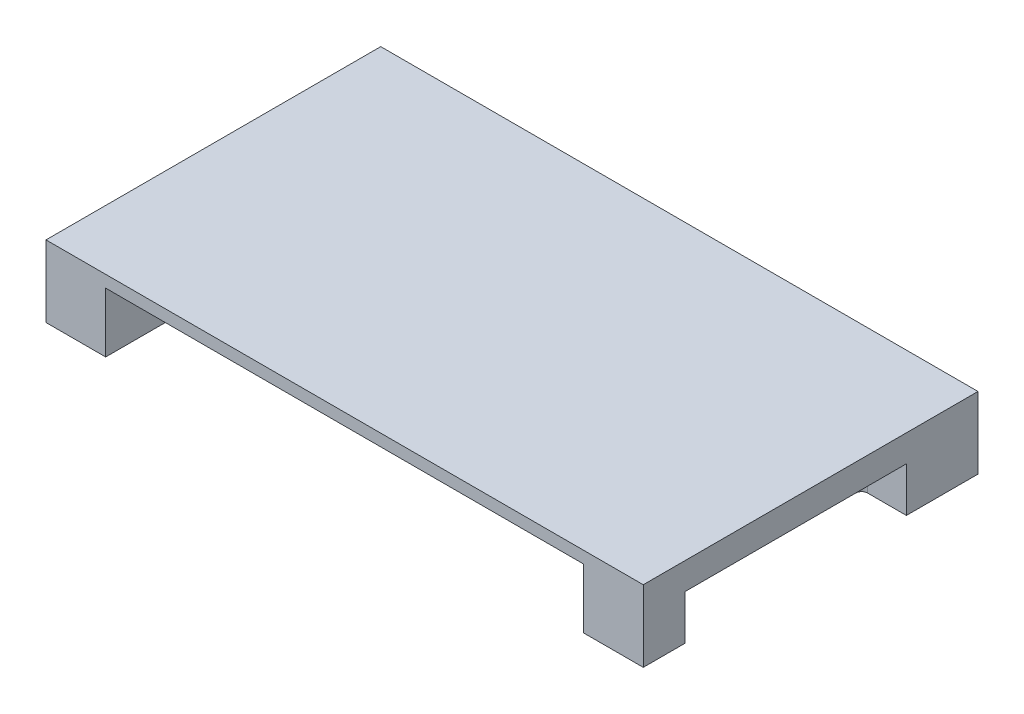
ISO-10303-21;
HEADER;
FILE_DESCRIPTION(('STEP AP214'),'2;1');
FILE_NAME('part.step','',(''),(''),'','','');
FILE_SCHEMA(('AUTOMOTIVE_DESIGN { 1 0 10303 214 1 1 1 1 }'));
ENDSEC;
DATA;
#1=APPLICATION_CONTEXT('core data for automotive mechanical design processes');
#2=APPLICATION_PROTOCOL_DEFINITION('international standard','automotive_design',2000,#1);
#3=PRODUCT_CONTEXT('',#1,'mechanical');
#4=PRODUCT('Part','Part','',(#3));
#5=PRODUCT_RELATED_PRODUCT_CATEGORY('part','',(#4));
#6=PRODUCT_DEFINITION_FORMATION('','',#4);
#7=PRODUCT_DEFINITION_CONTEXT('part definition',#1,'design');
#8=PRODUCT_DEFINITION('design','',#6,#7);
#9=PRODUCT_DEFINITION_SHAPE('','',#8);
#10=(LENGTH_UNIT() NAMED_UNIT(*) SI_UNIT(.MILLI.,.METRE.));
#11=(NAMED_UNIT(*) PLANE_ANGLE_UNIT() SI_UNIT($,.RADIAN.));
#12=(NAMED_UNIT(*) SI_UNIT($,.STERADIAN.) SOLID_ANGLE_UNIT());
#13=UNCERTAINTY_MEASURE_WITH_UNIT(LENGTH_MEASURE(1.E-05),#10,'distance_accuracy_value','');
#14=(GEOMETRIC_REPRESENTATION_CONTEXT(3) GLOBAL_UNCERTAINTY_ASSIGNED_CONTEXT((#13)) GLOBAL_UNIT_ASSIGNED_CONTEXT((#10,
#11,#12)) REPRESENTATION_CONTEXT('',''));
#15=CARTESIAN_POINT('',(0.,0.,0.));
#16=DIRECTION('',(0.,0.,1.));
#17=DIRECTION('',(1.,0.,0.));
#18=AXIS2_PLACEMENT_3D('',#15,#16,#17);
#19=CARTESIAN_POINT('',(93.6,-12.,-43.1));
#20=DIRECTION('',(0.,1.,0.));
#21=DIRECTION('',(0.,0.,1.));
#22=AXIS2_PLACEMENT_3D('',#19,#20,#21);
#23=PLANE('',#22);
#24=CARTESIAN_POINT('',(96.6,-12.,-3.50000000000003));
#25=DIRECTION('',(0.,1.,0.));
#26=DIRECTION('',(0.,0.,1.));
#27=AXIS2_PLACEMENT_3D('',#24,#25,#26);
#28=CIRCLE('',#27,0.5);
#29=CARTESIAN_POINT('',(97.1,-12.,-3.50000000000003));
#30=VERTEX_POINT('',#29);
#31=CARTESIAN_POINT('',(96.6,-12.,-4.00000000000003));
#32=VERTEX_POINT('',#31);
#33=EDGE_CURVE('E391',#30,#32,#28,.T.);
#34=ORIENTED_EDGE('',*,*,#33,.F.);
#35=DIRECTION('',(0.,0.,-1.));
#36=VECTOR('',#35,1.);
#37=CARTESIAN_POINT('',(97.1,-12.,-8.));
#38=LINE('',#37,#36);
#39=CARTESIAN_POINT('',(97.1,-12.,-2.50000000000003));
#40=VERTEX_POINT('',#39);
#41=EDGE_CURVE('E445',#40,#30,#38,.T.);
#42=ORIENTED_EDGE('',*,*,#41,.F.);
#43=DIRECTION('',(-1.,0.,0.));
#44=VECTOR('',#43,1.);
#45=CARTESIAN_POINT('',(6.5,-12.,-2.50000000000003));
#46=LINE('',#45,#44);
#47=CARTESIAN_POINT('',(98.1,-12.,-2.50000000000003));
#48=VERTEX_POINT('',#47);
#49=EDGE_CURVE('E475',#48,#40,#46,.T.);
#50=ORIENTED_EDGE('',*,*,#49,.F.);
#51=DIRECTION('',(0.,0.,1.));
#52=VECTOR('',#51,1.);
#53=CARTESIAN_POINT('',(98.1,-12.,-8.));
#54=LINE('',#53,#52);
#55=CARTESIAN_POINT('',(98.1,-12.,-3.99999999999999));
#56=VERTEX_POINT('',#55);
#57=EDGE_CURVE('E472',#56,#48,#54,.T.);
#58=ORIENTED_EDGE('',*,*,#57,.F.);
#59=CARTESIAN_POINT('',(97.1,-12.,-4.));
#60=DIRECTION('',(0.,1.,0.));
#61=DIRECTION('',(0.,0.,1.));
#62=AXIS2_PLACEMENT_3D('',#59,#60,#61);
#63=CIRCLE('',#62,1.);
#64=CARTESIAN_POINT('',(97.1,-12.,-5.));
#65=VERTEX_POINT('',#64);
#66=EDGE_CURVE('E470',#56,#65,#63,.T.);
#67=ORIENTED_EDGE('',*,*,#66,.T.);
#68=DIRECTION('',(1.,0.,0.));
#69=VECTOR('',#68,1.);
#70=CARTESIAN_POINT('',(6.5,-12.,-5.));
#71=LINE('',#70,#69);
#72=CARTESIAN_POINT('',(95.6,-12.,-5.));
#73=VERTEX_POINT('',#72);
#74=EDGE_CURVE('E467',#73,#65,#71,.T.);
#75=ORIENTED_EDGE('',*,*,#74,.F.);
#76=DIRECTION('',(0.,0.,-1.));
#77=VECTOR('',#76,1.);
#78=CARTESIAN_POINT('',(95.6,-12.,-8.));
#79=LINE('',#78,#77);
#80=CARTESIAN_POINT('',(95.6,-12.,-4.00000000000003));
#81=VERTEX_POINT('',#80);
#82=EDGE_CURVE('E464',#81,#73,#79,.T.);
#83=ORIENTED_EDGE('',*,*,#82,.F.);
#84=DIRECTION('',(-1.,0.,0.));
#85=VECTOR('',#84,1.);
#86=CARTESIAN_POINT('',(6.5,-12.,-4.00000000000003));
#87=LINE('',#86,#85);
#88=EDGE_CURVE('E64',#32,#81,#87,.T.);
#89=ORIENTED_EDGE('',*,*,#88,.F.);
#90=EDGE_LOOP('',(#34,#42,#50,#58,#67,#75,#83,#89));
#91=FACE_BOUND('',#90,.T.);
#92=CARTESIAN_POINT('',(93.6,-12.,-43.1));
#93=DIRECTION('',(0.,1.,0.));
#94=DIRECTION('',(0.,0.,1.));
#95=AXIS2_PLACEMENT_3D('',#92,#93,#94);
#96=CIRCLE('',#95,1.);
#97=CARTESIAN_POINT('',(93.6,-12.,-44.1));
#98=VERTEX_POINT('',#97);
#99=CARTESIAN_POINT('',(92.6,-12.,-43.1));
#100=VERTEX_POINT('',#99);
#101=EDGE_CURVE('E630',#98,#100,#96,.T.);
#102=ORIENTED_EDGE('',*,*,#101,.T.);
#103=DIRECTION('',(0.,0.,-1.));
#104=VECTOR('',#103,1.);
#105=CARTESIAN_POINT('',(92.6,-12.,0.));
#106=LINE('',#105,#104);
#107=CARTESIAN_POINT('',(92.6,-12.,-8.00000000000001));
#108=VERTEX_POINT('',#107);
#109=EDGE_CURVE('E632',#108,#100,#106,.T.);
#110=ORIENTED_EDGE('',*,*,#109,.F.);
#111=CARTESIAN_POINT('',(93.6,-12.,-8.));
#112=DIRECTION('',(0.,1.,0.));
#113=DIRECTION('',(0.,0.,1.));
#114=AXIS2_PLACEMENT_3D('',#111,#112,#113);
#115=CIRCLE('',#114,1.);
#116=CARTESIAN_POINT('',(93.6,-12.,-7.));
#117=VERTEX_POINT('',#116);
#118=EDGE_CURVE('E636',#108,#117,#115,.T.);
#119=ORIENTED_EDGE('',*,*,#118,.T.);
#120=DIRECTION('',(-1.,0.,0.));
#121=VECTOR('',#120,1.);
#122=CARTESIAN_POINT('',(0.,-12.,-7.));
#123=LINE('',#122,#121);
#124=CARTESIAN_POINT('',(100.1,-12.,-7.));
#125=VERTEX_POINT('',#124);
#126=EDGE_CURVE('E638',#125,#117,#123,.T.);
#127=ORIENTED_EDGE('',*,*,#126,.F.);
#128=DIRECTION('',(0.,0.,-1.));
#129=VECTOR('',#128,1.);
#130=CARTESIAN_POINT('',(100.1,-12.,0.));
#131=LINE('',#130,#129);
#132=CARTESIAN_POINT('',(100.1,-12.,0.));
#133=VERTEX_POINT('',#132);
#134=EDGE_CURVE('E641',#133,#125,#131,.T.);
#135=ORIENTED_EDGE('',*,*,#134,.F.);
#136=DIRECTION('',(1.,0.,0.));
#137=VECTOR('',#136,1.);
#138=CARTESIAN_POINT('',(0.,-12.,0.));
#139=LINE('',#138,#137);
#140=CARTESIAN_POINT('',(90.1,-12.,0.));
#141=VERTEX_POINT('',#140);
#142=EDGE_CURVE('E644',#141,#133,#139,.T.);
#143=ORIENTED_EDGE('',*,*,#142,.F.);
#144=DIRECTION('',(0.,0.,1.));
#145=VECTOR('',#144,1.);
#146=CARTESIAN_POINT('',(90.1,-12.,0.));
#147=LINE('',#146,#145);
#148=CARTESIAN_POINT('',(90.1,-12.,-56.1));
#149=VERTEX_POINT('',#148);
#150=EDGE_CURVE('E647',#149,#141,#147,.T.);
#151=ORIENTED_EDGE('',*,*,#150,.F.);
#152=DIRECTION('',(-1.,0.,0.));
#153=VECTOR('',#152,1.);
#154=CARTESIAN_POINT('',(0.,-12.,-56.1));
#155=LINE('',#154,#153);
#156=CARTESIAN_POINT('',(100.1,-12.,-56.1));
#157=VERTEX_POINT('',#156);
#158=EDGE_CURVE('E650',#157,#149,#155,.T.);
#159=ORIENTED_EDGE('',*,*,#158,.F.);
#160=DIRECTION('',(0.,0.,-1.));
#161=VECTOR('',#160,1.);
#162=CARTESIAN_POINT('',(100.1,-12.,0.));
#163=LINE('',#162,#161);
#164=CARTESIAN_POINT('',(100.1,-12.,-44.1));
#165=VERTEX_POINT('',#164);
#166=EDGE_CURVE('E653',#165,#157,#163,.T.);
#167=ORIENTED_EDGE('',*,*,#166,.F.);
#168=DIRECTION('',(1.,0.,0.));
#169=VECTOR('',#168,1.);
#170=CARTESIAN_POINT('',(0.,-12.,-44.1));
#171=LINE('',#170,#169);
#172=EDGE_CURVE('E656',#98,#165,#171,.T.);
#173=ORIENTED_EDGE('',*,*,#172,.F.);
#174=EDGE_LOOP('',(#102,#110,#119,#127,#135,#143,#151,#159,#167,#173));
#175=FACE_BOUND('',#174,.T.);
#176=CARTESIAN_POINT('',(96.6,-12.,-47.6));
#177=DIRECTION('',(0.,1.,0.));
#178=DIRECTION('',(0.,0.,1.));
#179=AXIS2_PLACEMENT_3D('',#176,#177,#178);
#180=CIRCLE('',#179,0.499999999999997);
#181=CARTESIAN_POINT('',(96.6,-12.,-47.1));
#182=VERTEX_POINT('',#181);
#183=CARTESIAN_POINT('',(97.1,-12.,-47.6));
#184=VERTEX_POINT('',#183);
#185=EDGE_CURVE('E387',#182,#184,#180,.T.);
#186=ORIENTED_EDGE('',*,*,#185,.F.);
#187=DIRECTION('',(-1.,0.,0.));
#188=VECTOR('',#187,1.);
#189=CARTESIAN_POINT('',(6.5,-12.,-47.1));
#190=LINE('',#189,#188);
#191=CARTESIAN_POINT('',(95.6,-12.,-47.1));
#192=VERTEX_POINT('',#191);
#193=EDGE_CURVE('E381',#182,#192,#190,.T.);
#194=ORIENTED_EDGE('',*,*,#193,.T.);
#195=DIRECTION('',(0.,0.,1.));
#196=VECTOR('',#195,1.);
#197=CARTESIAN_POINT('',(95.6,-12.,-8.));
#198=LINE('',#197,#196);
#199=CARTESIAN_POINT('',(95.6,-12.,-46.1));
#200=VERTEX_POINT('',#199);
#201=EDGE_CURVE('E56',#192,#200,#198,.T.);
#202=ORIENTED_EDGE('',*,*,#201,.T.);
#203=DIRECTION('',(-1.,0.,0.));
#204=VECTOR('',#203,1.);
#205=CARTESIAN_POINT('',(6.5,-12.,-46.1));
#206=LINE('',#205,#204);
#207=CARTESIAN_POINT('',(97.1,-12.,-46.1));
#208=VERTEX_POINT('',#207);
#209=EDGE_CURVE('E423',#208,#200,#206,.T.);
#210=ORIENTED_EDGE('',*,*,#209,.F.);
#211=CARTESIAN_POINT('',(97.1,-12.,-47.1));
#212=DIRECTION('',(0.,1.,0.));
#213=DIRECTION('',(0.,0.,1.));
#214=AXIS2_PLACEMENT_3D('',#211,#212,#213);
#215=CIRCLE('',#214,1.);
#216=CARTESIAN_POINT('',(98.1,-12.,-47.1));
#217=VERTEX_POINT('',#216);
#218=EDGE_CURVE('E420',#208,#217,#215,.T.);
#219=ORIENTED_EDGE('',*,*,#218,.T.);
#220=DIRECTION('',(0.,0.,1.));
#221=VECTOR('',#220,1.);
#222=CARTESIAN_POINT('',(98.1000000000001,-12.,-8.00000000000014));
#223=LINE('',#222,#221);
#224=CARTESIAN_POINT('',(98.1,-12.,-48.6));
#225=VERTEX_POINT('',#224);
#226=EDGE_CURVE('E417',#225,#217,#223,.T.);
#227=ORIENTED_EDGE('',*,*,#226,.F.);
#228=DIRECTION('',(-1.,0.,0.));
#229=VECTOR('',#228,1.);
#230=CARTESIAN_POINT('',(6.5,-12.,-48.6));
#231=LINE('',#230,#229);
#232=CARTESIAN_POINT('',(97.1,-12.,-48.6));
#233=VERTEX_POINT('',#232);
#234=EDGE_CURVE('E414',#225,#233,#231,.T.);
#235=ORIENTED_EDGE('',*,*,#234,.T.);
#236=DIRECTION('',(0.,0.,1.));
#237=VECTOR('',#236,1.);
#238=CARTESIAN_POINT('',(97.1,-12.,-8.));
#239=LINE('',#238,#237);
#240=EDGE_CURVE('E412',#233,#184,#239,.T.);
#241=ORIENTED_EDGE('',*,*,#240,.T.);
#242=EDGE_LOOP('',(#186,#194,#202,#210,#219,#227,#235,#241));
#243=FACE_BOUND('',#242,.T.);
#244=ADVANCED_FACE('F39',(#91,#175,#243),#23,.F.);
#245=CARTESIAN_POINT('',(6.5,-12.,-8.));
#246=DIRECTION('',(0.,1.,0.));
#247=DIRECTION('',(0.,0.,1.));
#248=AXIS2_PLACEMENT_3D('',#245,#246,#247);
#249=PLANE('',#248);
#250=CARTESIAN_POINT('',(3.5,-12.,-47.6));
#251=DIRECTION('',(0.,1.,0.));
#252=DIRECTION('',(0.,0.,1.));
#253=AXIS2_PLACEMENT_3D('',#250,#251,#252);
#254=CIRCLE('',#253,0.499999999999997);
#255=CARTESIAN_POINT('',(3.,-12.,-47.6));
#256=VERTEX_POINT('',#255);
#257=CARTESIAN_POINT('',(3.5,-12.,-47.1));
#258=VERTEX_POINT('',#257);
#259=EDGE_CURVE('E564',#256,#258,#254,.T.);
#260=ORIENTED_EDGE('',*,*,#259,.F.);
#261=DIRECTION('',(0.,0.,1.));
#262=VECTOR('',#261,1.);
#263=CARTESIAN_POINT('',(3.,-12.,-8.));
#264=LINE('',#263,#262);
#265=CARTESIAN_POINT('',(3.,-12.,-48.6));
#266=VERTEX_POINT('',#265);
#267=EDGE_CURVE('E569',#266,#256,#264,.T.);
#268=ORIENTED_EDGE('',*,*,#267,.F.);
#269=DIRECTION('',(1.,0.,0.));
#270=VECTOR('',#269,1.);
#271=CARTESIAN_POINT('',(6.5,-12.,-48.6));
#272=LINE('',#271,#270);
#273=CARTESIAN_POINT('',(2.,-12.,-48.6));
#274=VERTEX_POINT('',#273);
#275=EDGE_CURVE('E601',#274,#266,#272,.T.);
#276=ORIENTED_EDGE('',*,*,#275,.F.);
#277=DIRECTION('',(0.,0.,-1.));
#278=VECTOR('',#277,1.);
#279=CARTESIAN_POINT('',(2.,-12.,-8.));
#280=LINE('',#279,#278);
#281=CARTESIAN_POINT('',(2.,-12.,-47.1));
#282=VERTEX_POINT('',#281);
#283=EDGE_CURVE('E598',#282,#274,#280,.T.);
#284=ORIENTED_EDGE('',*,*,#283,.F.);
#285=CARTESIAN_POINT('',(3.,-12.,-47.1));
#286=DIRECTION('',(0.,1.,0.));
#287=DIRECTION('',(0.,0.,1.));
#288=AXIS2_PLACEMENT_3D('',#285,#286,#287);
#289=CIRCLE('',#288,1.);
#290=CARTESIAN_POINT('',(3.,-12.,-46.1));
#291=VERTEX_POINT('',#290);
#292=EDGE_CURVE('E596',#282,#291,#289,.T.);
#293=ORIENTED_EDGE('',*,*,#292,.T.);
#294=DIRECTION('',(-1.,0.,0.));
#295=VECTOR('',#294,1.);
#296=CARTESIAN_POINT('',(6.5,-12.,-46.1));
#297=LINE('',#296,#295);
#298=CARTESIAN_POINT('',(4.5,-12.,-46.1));
#299=VERTEX_POINT('',#298);
#300=EDGE_CURVE('E593',#299,#291,#297,.T.);
#301=ORIENTED_EDGE('',*,*,#300,.F.);
#302=DIRECTION('',(0.,0.,1.));
#303=VECTOR('',#302,1.);
#304=CARTESIAN_POINT('',(4.5,-12.,-8.));
#305=LINE('',#304,#303);
#306=CARTESIAN_POINT('',(4.5,-12.,-47.1));
#307=VERTEX_POINT('',#306);
#308=EDGE_CURVE('E590',#307,#299,#305,.T.);
#309=ORIENTED_EDGE('',*,*,#308,.F.);
#310=DIRECTION('',(1.,0.,0.));
#311=VECTOR('',#310,1.);
#312=CARTESIAN_POINT('',(6.5,-12.,-47.1));
#313=LINE('',#312,#311);
#314=EDGE_CURVE('E587',#258,#307,#313,.T.);
#315=ORIENTED_EDGE('',*,*,#314,.F.);
#316=EDGE_LOOP('',(#260,#268,#276,#284,#293,#301,#309,#315));
#317=FACE_BOUND('',#316,.T.);
#318=CARTESIAN_POINT('',(6.5,-12.,-8.));
#319=DIRECTION('',(0.,1.,0.));
#320=DIRECTION('',(0.,0.,1.));
#321=AXIS2_PLACEMENT_3D('',#318,#319,#320);
#322=CIRCLE('',#321,1.);
#323=CARTESIAN_POINT('',(6.49999999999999,-12.,-7.));
#324=VERTEX_POINT('',#323);
#325=CARTESIAN_POINT('',(7.5,-12.,-8.00000000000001));
#326=VERTEX_POINT('',#325);
#327=EDGE_CURVE('E685',#324,#326,#322,.T.);
#328=ORIENTED_EDGE('',*,*,#327,.T.);
#329=DIRECTION('',(0.,0.,1.));
#330=VECTOR('',#329,1.);
#331=CARTESIAN_POINT('',(7.5,-12.,0.));
#332=LINE('',#331,#330);
#333=CARTESIAN_POINT('',(7.5,-12.,-43.1));
#334=VERTEX_POINT('',#333);
#335=EDGE_CURVE('E687',#334,#326,#332,.T.);
#336=ORIENTED_EDGE('',*,*,#335,.F.);
#337=CARTESIAN_POINT('',(6.5,-12.,-43.1));
#338=DIRECTION('',(0.,1.,0.));
#339=DIRECTION('',(0.,0.,1.));
#340=AXIS2_PLACEMENT_3D('',#337,#338,#339);
#341=CIRCLE('',#340,1.);
#342=CARTESIAN_POINT('',(6.5,-12.,-44.1));
#343=VERTEX_POINT('',#342);
#344=EDGE_CURVE('E691',#334,#343,#341,.T.);
#345=ORIENTED_EDGE('',*,*,#344,.T.);
#346=DIRECTION('',(1.,0.,0.));
#347=VECTOR('',#346,1.);
#348=CARTESIAN_POINT('',(0.,-12.,-44.1));
#349=LINE('',#348,#347);
#350=CARTESIAN_POINT('',(0.,-12.,-44.1));
#351=VERTEX_POINT('',#350);
#352=EDGE_CURVE('E693',#351,#343,#349,.T.);
#353=ORIENTED_EDGE('',*,*,#352,.F.);
#354=DIRECTION('',(0.,0.,1.));
#355=VECTOR('',#354,1.);
#356=CARTESIAN_POINT('',(0.,-12.,0.));
#357=LINE('',#356,#355);
#358=CARTESIAN_POINT('',(0.,-12.,-56.1));
#359=VERTEX_POINT('',#358);
#360=EDGE_CURVE('E696',#359,#351,#357,.T.);
#361=ORIENTED_EDGE('',*,*,#360,.F.);
#362=DIRECTION('',(-1.,0.,0.));
#363=VECTOR('',#362,1.);
#364=CARTESIAN_POINT('',(1.94635974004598E-13,-12.,-56.1));
#365=LINE('',#364,#363);
#366=CARTESIAN_POINT('',(10.,-12.,-56.1));
#367=VERTEX_POINT('',#366);
#368=EDGE_CURVE('E699',#367,#359,#365,.T.);
#369=ORIENTED_EDGE('',*,*,#368,.F.);
#370=DIRECTION('',(0.,0.,-1.));
#371=VECTOR('',#370,1.);
#372=CARTESIAN_POINT('',(10.,-12.,0.));
#373=LINE('',#372,#371);
#374=CARTESIAN_POINT('',(10.,-12.,0.));
#375=VERTEX_POINT('',#374);
#376=EDGE_CURVE('E702',#375,#367,#373,.T.);
#377=ORIENTED_EDGE('',*,*,#376,.F.);
#378=DIRECTION('',(1.,0.,0.));
#379=VECTOR('',#378,1.);
#380=CARTESIAN_POINT('',(0.,-12.,0.));
#381=LINE('',#380,#379);
#382=CARTESIAN_POINT('',(0.,-12.,0.));
#383=VERTEX_POINT('',#382);
#384=EDGE_CURVE('E705',#383,#375,#381,.T.);
#385=ORIENTED_EDGE('',*,*,#384,.F.);
#386=DIRECTION('',(0.,0.,-1.));
#387=VECTOR('',#386,1.);
#388=CARTESIAN_POINT('',(0.,-12.,0.));
#389=LINE('',#388,#387);
#390=CARTESIAN_POINT('',(0.,-12.,-7.));
#391=VERTEX_POINT('',#390);
#392=EDGE_CURVE('E708',#383,#391,#389,.T.);
#393=ORIENTED_EDGE('',*,*,#392,.T.);
#394=DIRECTION('',(1.,0.,0.));
#395=VECTOR('',#394,1.);
#396=CARTESIAN_POINT('',(0.,-12.,-7.));
#397=LINE('',#396,#395);
#398=EDGE_CURVE('E710',#391,#324,#397,.T.);
#399=ORIENTED_EDGE('',*,*,#398,.T.);
#400=EDGE_LOOP('',(#328,#336,#345,#353,#361,#369,#377,#385,#393,#399));
#401=FACE_BOUND('',#400,.T.);
#402=CARTESIAN_POINT('',(3.5,-12.,-3.5));
#403=DIRECTION('',(0.,1.,0.));
#404=DIRECTION('',(0.,0.,1.));
#405=AXIS2_PLACEMENT_3D('',#402,#403,#404);
#406=CIRCLE('',#405,0.5);
#407=CARTESIAN_POINT('',(3.5,-12.,-4.));
#408=VERTEX_POINT('',#407);
#409=CARTESIAN_POINT('',(3.,-12.,-3.5));
#410=VERTEX_POINT('',#409);
#411=EDGE_CURVE('E502',#408,#410,#406,.T.);
#412=ORIENTED_EDGE('',*,*,#411,.F.);
#413=DIRECTION('',(1.,0.,0.));
#414=VECTOR('',#413,1.);
#415=CARTESIAN_POINT('',(6.5,-12.,-4.));
#416=LINE('',#415,#414);
#417=CARTESIAN_POINT('',(4.5,-12.,-4.));
#418=VERTEX_POINT('',#417);
#419=EDGE_CURVE('E506',#408,#418,#416,.T.);
#420=ORIENTED_EDGE('',*,*,#419,.T.);
#421=DIRECTION('',(0.,0.,-1.));
#422=VECTOR('',#421,1.);
#423=CARTESIAN_POINT('',(4.5,-12.,-8.));
#424=LINE('',#423,#422);
#425=CARTESIAN_POINT('',(4.5,-12.,-5.));
#426=VERTEX_POINT('',#425);
#427=EDGE_CURVE('E543',#418,#426,#424,.T.);
#428=ORIENTED_EDGE('',*,*,#427,.T.);
#429=DIRECTION('',(1.,0.,0.));
#430=VECTOR('',#429,1.);
#431=CARTESIAN_POINT('',(6.5,-12.,-5.));
#432=LINE('',#431,#430);
#433=CARTESIAN_POINT('',(3.00000000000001,-12.,-5.));
#434=VERTEX_POINT('',#433);
#435=EDGE_CURVE('E540',#434,#426,#432,.T.);
#436=ORIENTED_EDGE('',*,*,#435,.F.);
#437=CARTESIAN_POINT('',(3.,-12.,-4.));
#438=DIRECTION('',(0.,1.,0.));
#439=DIRECTION('',(0.,0.,1.));
#440=AXIS2_PLACEMENT_3D('',#437,#438,#439);
#441=CIRCLE('',#440,1.);
#442=CARTESIAN_POINT('',(2.,-12.,-3.99999999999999));
#443=VERTEX_POINT('',#442);
#444=EDGE_CURVE('E537',#434,#443,#441,.T.);
#445=ORIENTED_EDGE('',*,*,#444,.T.);
#446=DIRECTION('',(0.,0.,-1.));
#447=VECTOR('',#446,1.);
#448=CARTESIAN_POINT('',(2.,-12.,-8.));
#449=LINE('',#448,#447);
#450=CARTESIAN_POINT('',(2.,-12.,-2.5));
#451=VERTEX_POINT('',#450);
#452=EDGE_CURVE('E534',#451,#443,#449,.T.);
#453=ORIENTED_EDGE('',*,*,#452,.F.);
#454=DIRECTION('',(1.,0.,0.));
#455=VECTOR('',#454,1.);
#456=CARTESIAN_POINT('',(6.5,-12.,-2.5));
#457=LINE('',#456,#455);
#458=CARTESIAN_POINT('',(3.,-12.,-2.5));
#459=VERTEX_POINT('',#458);
#460=EDGE_CURVE('E531',#451,#459,#457,.T.);
#461=ORIENTED_EDGE('',*,*,#460,.T.);
#462=DIRECTION('',(0.,0.,-1.));
#463=VECTOR('',#462,1.);
#464=CARTESIAN_POINT('',(3.,-12.,-8.));
#465=LINE('',#464,#463);
#466=EDGE_CURVE('E528',#459,#410,#465,.T.);
#467=ORIENTED_EDGE('',*,*,#466,.T.);
#468=EDGE_LOOP('',(#412,#420,#428,#436,#445,#453,#461,#467));
#469=FACE_BOUND('',#468,.T.);
#470=ADVANCED_FACE('F802',(#317,#401,#469),#249,.F.);
#471=CARTESIAN_POINT('',(0.,-4.5,0.));
#472=DIRECTION('',(0.,0.,1.));
#473=DIRECTION('',(1.,0.,0.));
#474=AXIS2_PLACEMENT_3D('',#471,#472,#473);
#475=PLANE('',#474);
#476=DIRECTION('',(1.,0.,0.));
#477=VECTOR('',#476,1.);
#478=CARTESIAN_POINT('',(0.,0.,0.));
#479=LINE('',#478,#477);
#480=CARTESIAN_POINT('',(0.,0.,0.));
#481=VERTEX_POINT('',#480);
#482=CARTESIAN_POINT('',(100.1,0.,0.));
#483=VERTEX_POINT('',#482);
#484=EDGE_CURVE('E771',#481,#483,#479,.T.);
#485=ORIENTED_EDGE('',*,*,#484,.F.);
#486=DIRECTION('',(0.,1.,0.));
#487=VECTOR('',#486,1.);
#488=CARTESIAN_POINT('',(0.,-4.5,0.));
#489=LINE('',#488,#487);
#490=EDGE_CURVE('E748',#383,#481,#489,.T.);
#491=ORIENTED_EDGE('',*,*,#490,.F.);
#492=ORIENTED_EDGE('',*,*,#384,.T.);
#493=DIRECTION('',(0.,1.,0.));
#494=VECTOR('',#493,1.);
#495=CARTESIAN_POINT('',(10.,-4.5,0.));
#496=LINE('',#495,#494);
#497=CARTESIAN_POINT('',(10.,-2.,0.));
#498=VERTEX_POINT('',#497);
#499=EDGE_CURVE('E745',#375,#498,#496,.T.);
#500=ORIENTED_EDGE('',*,*,#499,.T.);
#501=DIRECTION('',(1.,0.,0.));
#502=VECTOR('',#501,1.);
#503=CARTESIAN_POINT('',(0.,-2.,0.));
#504=LINE('',#503,#502);
#505=CARTESIAN_POINT('',(90.1,-2.,0.));
#506=VERTEX_POINT('',#505);
#507=EDGE_CURVE('E768',#498,#506,#504,.T.);
#508=ORIENTED_EDGE('',*,*,#507,.T.);
#509=DIRECTION('',(0.,1.,0.));
#510=VECTOR('',#509,1.);
#511=CARTESIAN_POINT('',(90.1,-4.5,0.));
#512=LINE('',#511,#510);
#513=EDGE_CURVE('E11',#141,#506,#512,.T.);
#514=ORIENTED_EDGE('',*,*,#513,.F.);
#515=ORIENTED_EDGE('',*,*,#142,.T.);
#516=DIRECTION('',(0.,1.,0.));
#517=VECTOR('',#516,1.);
#518=CARTESIAN_POINT('',(100.1,-4.5,0.));
#519=LINE('',#518,#517);
#520=EDGE_CURVE('E43',#133,#483,#519,.T.);
#521=ORIENTED_EDGE('',*,*,#520,.T.);
#522=EDGE_LOOP('',(#485,#491,#492,#500,#508,#514,#515,#521));
#523=FACE_BOUND('',#522,.T.);
#524=ADVANCED_FACE('F41',(#523),#475,.T.);
#525=CARTESIAN_POINT('',(90.1,-4.5,0.));
#526=DIRECTION('',(-1.,0.,0.));
#527=DIRECTION('',(0.,0.,1.));
#528=AXIS2_PLACEMENT_3D('',#525,#526,#527);
#529=PLANE('',#528);
#530=DIRECTION('',(0.,0.,1.));
#531=VECTOR('',#530,1.);
#532=CARTESIAN_POINT('',(90.1,-2.,0.));
#533=LINE('',#532,#531);
#534=CARTESIAN_POINT('',(90.1,-2.,-56.1));
#535=VERTEX_POINT('',#534);
#536=EDGE_CURVE('E751',#535,#506,#533,.T.);
#537=ORIENTED_EDGE('',*,*,#536,.F.);
#538=DIRECTION('',(0.,1.,0.));
#539=VECTOR('',#538,1.);
#540=CARTESIAN_POINT('',(90.1,-4.5,-56.1));
#541=LINE('',#540,#539);
#542=EDGE_CURVE('E48',#149,#535,#541,.T.);
#543=ORIENTED_EDGE('',*,*,#542,.F.);
#544=ORIENTED_EDGE('',*,*,#150,.T.);
#545=ORIENTED_EDGE('',*,*,#513,.T.);
#546=EDGE_LOOP('',(#537,#543,#544,#545));
#547=FACE_BOUND('',#546,.T.);
#548=ADVANCED_FACE('F816',(#547),#529,.T.);
#549=CARTESIAN_POINT('',(0.,-4.5,-56.1));
#550=DIRECTION('',(0.,0.,-1.));
#551=DIRECTION('',(-1.,0.,0.));
#552=AXIS2_PLACEMENT_3D('',#549,#550,#551);
#553=PLANE('',#552);
#554=DIRECTION('',(-1.,0.,0.));
#555=VECTOR('',#554,1.);
#556=CARTESIAN_POINT('',(0.,0.,-56.1));
#557=LINE('',#556,#555);
#558=CARTESIAN_POINT('',(100.1,0.,-56.1));
#559=VERTEX_POINT('',#558);
#560=CARTESIAN_POINT('',(0.,0.,-56.1));
#561=VERTEX_POINT('',#560);
#562=EDGE_CURVE('E775',#559,#561,#557,.T.);
#563=ORIENTED_EDGE('',*,*,#562,.F.);
#564=DIRECTION('',(0.,1.,0.));
#565=VECTOR('',#564,1.);
#566=CARTESIAN_POINT('',(100.1,-4.5,-56.1));
#567=LINE('',#566,#565);
#568=EDGE_CURVE('E783',#157,#559,#567,.T.);
#569=ORIENTED_EDGE('',*,*,#568,.F.);
#570=ORIENTED_EDGE('',*,*,#158,.T.);
#571=ORIENTED_EDGE('',*,*,#542,.T.);
#572=DIRECTION('',(1.,0.,0.));
#573=VECTOR('',#572,1.);
#574=CARTESIAN_POINT('',(0.,-2.,-56.1));
#575=LINE('',#574,#573);
#576=CARTESIAN_POINT('',(9.99999999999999,-2.,-56.1));
#577=VERTEX_POINT('',#576);
#578=EDGE_CURVE('E762',#577,#535,#575,.T.);
#579=ORIENTED_EDGE('',*,*,#578,.F.);
#580=DIRECTION('',(0.,1.,0.));
#581=VECTOR('',#580,1.);
#582=CARTESIAN_POINT('',(9.99999999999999,-4.5,-56.1));
#583=LINE('',#582,#581);
#584=EDGE_CURVE('E755',#367,#577,#583,.T.);
#585=ORIENTED_EDGE('',*,*,#584,.F.);
#586=ORIENTED_EDGE('',*,*,#368,.T.);
#587=DIRECTION('',(0.,1.,0.));
#588=VECTOR('',#587,1.);
#589=CARTESIAN_POINT('',(0.,-4.5,-56.1));
#590=LINE('',#589,#588);
#591=EDGE_CURVE('E752',#359,#561,#590,.T.);
#592=ORIENTED_EDGE('',*,*,#591,.T.);
#593=EDGE_LOOP('',(#563,#569,#570,#571,#579,#585,#586,#592));
#594=FACE_BOUND('',#593,.T.);
#595=ADVANCED_FACE('F818',(#594),#553,.T.);
#596=CARTESIAN_POINT('',(100.1,-4.5,0.));
#597=DIRECTION('',(1.,0.,0.));
#598=DIRECTION('',(0.,0.,-1.));
#599=AXIS2_PLACEMENT_3D('',#596,#597,#598);
#600=PLANE('',#599);
#601=DIRECTION('',(0.,0.,-1.));
#602=VECTOR('',#601,1.);
#603=CARTESIAN_POINT('',(100.1,0.,0.));
#604=LINE('',#603,#602);
#605=EDGE_CURVE('E778',#483,#559,#604,.T.);
#606=ORIENTED_EDGE('',*,*,#605,.F.);
#607=ORIENTED_EDGE('',*,*,#520,.F.);
#608=ORIENTED_EDGE('',*,*,#134,.T.);
#609=DIRECTION('',(0.,1.,0.));
#610=VECTOR('',#609,1.);
#611=CARTESIAN_POINT('',(100.1,-12.,-7.));
#612=LINE('',#611,#610);
#613=CARTESIAN_POINT('',(100.1,-4.5,-7.));
#614=VERTEX_POINT('',#613);
#615=EDGE_CURVE('E676',#125,#614,#612,.T.);
#616=ORIENTED_EDGE('',*,*,#615,.T.);
#617=DIRECTION('',(0.,0.,-1.));
#618=VECTOR('',#617,1.);
#619=CARTESIAN_POINT('',(100.1,-4.5,0.));
#620=LINE('',#619,#618);
#621=CARTESIAN_POINT('',(100.1,-4.5,-44.1));
#622=VERTEX_POINT('',#621);
#623=EDGE_CURVE('E772',#614,#622,#620,.T.);
#624=ORIENTED_EDGE('',*,*,#623,.T.);
#625=DIRECTION('',(0.,1.,0.));
#626=VECTOR('',#625,1.);
#627=CARTESIAN_POINT('',(100.1,-12.,-44.1));
#628=LINE('',#627,#626);
#629=EDGE_CURVE('E674',#165,#622,#628,.T.);
#630=ORIENTED_EDGE('',*,*,#629,.F.);
#631=ORIENTED_EDGE('',*,*,#166,.T.);
#632=ORIENTED_EDGE('',*,*,#568,.T.);
#633=EDGE_LOOP('',(#606,#607,#608,#616,#624,#630,#631,#632));
#634=FACE_BOUND('',#633,.T.);
#635=ADVANCED_FACE('F790',(#634),#600,.T.);
#636=CARTESIAN_POINT('',(0.,-4.5,0.));
#637=DIRECTION('',(0.,1.,0.));
#638=DIRECTION('',(0.,0.,1.));
#639=AXIS2_PLACEMENT_3D('',#636,#637,#638);
#640=PLANE('',#639);
#641=ORIENTED_EDGE('',*,*,#623,.F.);
#642=DIRECTION('',(-1.,0.,0.));
#643=VECTOR('',#642,1.);
#644=CARTESIAN_POINT('',(0.,-4.5,-7.));
#645=LINE('',#644,#643);
#646=CARTESIAN_POINT('',(93.6,-4.5,-7.));
#647=VERTEX_POINT('',#646);
#648=EDGE_CURVE('E668',#614,#647,#645,.T.);
#649=ORIENTED_EDGE('',*,*,#648,.T.);
#650=CARTESIAN_POINT('',(93.6,-4.5,-8.));
#651=DIRECTION('',(0.,1.,0.));
#652=DIRECTION('',(0.,0.,1.));
#653=AXIS2_PLACEMENT_3D('',#650,#651,#652);
#654=CIRCLE('',#653,1.);
#655=CARTESIAN_POINT('',(92.6,-4.5,-8.00000000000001));
#656=VERTEX_POINT('',#655);
#657=EDGE_CURVE('E665',#656,#647,#654,.T.);
#658=ORIENTED_EDGE('',*,*,#657,.F.);
#659=DIRECTION('',(0.,0.,-1.));
#660=VECTOR('',#659,1.);
#661=CARTESIAN_POINT('',(92.6,-4.5,0.));
#662=LINE('',#661,#660);
#663=CARTESIAN_POINT('',(92.6,-4.5,-43.1));
#664=VERTEX_POINT('',#663);
#665=EDGE_CURVE('E662',#656,#664,#662,.T.);
#666=ORIENTED_EDGE('',*,*,#665,.T.);
#667=CARTESIAN_POINT('',(93.6,-4.5,-43.1));
#668=DIRECTION('',(0.,1.,0.));
#669=DIRECTION('',(0.,0.,1.));
#670=AXIS2_PLACEMENT_3D('',#667,#668,#669);
#671=CIRCLE('',#670,1.);
#672=CARTESIAN_POINT('',(93.6,-4.5,-44.1));
#673=VERTEX_POINT('',#672);
#674=EDGE_CURVE('E629',#673,#664,#671,.T.);
#675=ORIENTED_EDGE('',*,*,#674,.F.);
#676=DIRECTION('',(1.,0.,0.));
#677=VECTOR('',#676,1.);
#678=CARTESIAN_POINT('',(0.,-4.5,-44.1));
#679=LINE('',#678,#677);
#680=EDGE_CURVE('E633',#673,#622,#679,.T.);
#681=ORIENTED_EDGE('',*,*,#680,.T.);
#682=EDGE_LOOP('',(#641,#649,#658,#666,#675,#681));
#683=FACE_BOUND('',#682,.T.);
#684=ADVANCED_FACE('F827',(#683),#640,.F.);
#685=CARTESIAN_POINT('',(0.,0.,0.));
#686=DIRECTION('',(0.,1.,0.));
#687=DIRECTION('',(0.,0.,1.));
#688=AXIS2_PLACEMENT_3D('',#685,#686,#687);
#689=PLANE('',#688);
#690=ORIENTED_EDGE('',*,*,#484,.T.);
#691=ORIENTED_EDGE('',*,*,#605,.T.);
#692=ORIENTED_EDGE('',*,*,#562,.T.);
#693=DIRECTION('',(0.,0.,1.));
#694=VECTOR('',#693,1.);
#695=CARTESIAN_POINT('',(0.,0.,0.));
#696=LINE('',#695,#694);
#697=EDGE_CURVE('E741',#561,#481,#696,.T.);
#698=ORIENTED_EDGE('',*,*,#697,.T.);
#699=EDGE_LOOP('',(#690,#691,#692,#698));
#700=FACE_BOUND('',#699,.T.);
#701=ADVANCED_FACE('F792',(#700),#689,.T.);
#702=CARTESIAN_POINT('',(0.,-2.,0.));
#703=DIRECTION('',(0.,1.,0.));
#704=DIRECTION('',(0.,0.,1.));
#705=AXIS2_PLACEMENT_3D('',#702,#703,#704);
#706=PLANE('',#705);
#707=ORIENTED_EDGE('',*,*,#536,.T.);
#708=ORIENTED_EDGE('',*,*,#507,.F.);
#709=DIRECTION('',(0.,0.,1.));
#710=VECTOR('',#709,1.);
#711=CARTESIAN_POINT('',(10.,-2.,0.));
#712=LINE('',#711,#710);
#713=EDGE_CURVE('E765',#577,#498,#712,.T.);
#714=ORIENTED_EDGE('',*,*,#713,.F.);
#715=ORIENTED_EDGE('',*,*,#578,.T.);
#716=EDGE_LOOP('',(#707,#708,#714,#715));
#717=FACE_BOUND('',#716,.T.);
#718=ADVANCED_FACE('F809',(#717),#706,.F.);
#719=CARTESIAN_POINT('',(10.,-4.5,0.));
#720=DIRECTION('',(-1.,0.,0.));
#721=DIRECTION('',(0.,0.,1.));
#722=AXIS2_PLACEMENT_3D('',#719,#720,#721);
#723=PLANE('',#722);
#724=ORIENTED_EDGE('',*,*,#584,.T.);
#725=ORIENTED_EDGE('',*,*,#713,.T.);
#726=ORIENTED_EDGE('',*,*,#499,.F.);
#727=ORIENTED_EDGE('',*,*,#376,.T.);
#728=EDGE_LOOP('',(#724,#725,#726,#727));
#729=FACE_BOUND('',#728,.T.);
#730=ADVANCED_FACE('F806',(#729),#723,.F.);
#731=CARTESIAN_POINT('',(0.,-4.5,0.));
#732=DIRECTION('',(-1.,0.,0.));
#733=DIRECTION('',(0.,0.,1.));
#734=AXIS2_PLACEMENT_3D('',#731,#732,#733);
#735=PLANE('',#734);
#736=ORIENTED_EDGE('',*,*,#697,.F.);
#737=ORIENTED_EDGE('',*,*,#591,.F.);
#738=ORIENTED_EDGE('',*,*,#360,.T.);
#739=DIRECTION('',(0.,1.,0.));
#740=VECTOR('',#739,1.);
#741=CARTESIAN_POINT('',(0.,-12.,-44.1));
#742=LINE('',#741,#740);
#743=CARTESIAN_POINT('',(0.,-4.5,-44.1));
#744=VERTEX_POINT('',#743);
#745=EDGE_CURVE('E729',#351,#744,#742,.T.);
#746=ORIENTED_EDGE('',*,*,#745,.T.);
#747=DIRECTION('',(0.,0.,1.));
#748=VECTOR('',#747,1.);
#749=CARTESIAN_POINT('',(0.,-4.5,0.));
#750=LINE('',#749,#748);
#751=CARTESIAN_POINT('',(0.,-4.5,-7.));
#752=VERTEX_POINT('',#751);
#753=EDGE_CURVE('E742',#744,#752,#750,.T.);
#754=ORIENTED_EDGE('',*,*,#753,.T.);
#755=DIRECTION('',(0.,1.,0.));
#756=VECTOR('',#755,1.);
#757=CARTESIAN_POINT('',(0.,-12.,-7.));
#758=LINE('',#757,#756);
#759=EDGE_CURVE('E726',#391,#752,#758,.T.);
#760=ORIENTED_EDGE('',*,*,#759,.F.);
#761=ORIENTED_EDGE('',*,*,#392,.F.);
#762=ORIENTED_EDGE('',*,*,#490,.T.);
#763=EDGE_LOOP('',(#736,#737,#738,#746,#754,#760,#761,#762));
#764=FACE_BOUND('',#763,.T.);
#765=ADVANCED_FACE('F795',(#764),#735,.T.);
#766=CARTESIAN_POINT('',(0.,-4.5,0.));
#767=DIRECTION('',(0.,1.,0.));
#768=DIRECTION('',(0.,0.,1.));
#769=AXIS2_PLACEMENT_3D('',#766,#767,#768);
#770=PLANE('',#769);
#771=ORIENTED_EDGE('',*,*,#753,.F.);
#772=DIRECTION('',(1.,0.,0.));
#773=VECTOR('',#772,1.);
#774=CARTESIAN_POINT('',(0.,-4.5,-44.1));
#775=LINE('',#774,#773);
#776=CARTESIAN_POINT('',(6.5,-4.5,-44.1));
#777=VERTEX_POINT('',#776);
#778=EDGE_CURVE('E720',#744,#777,#775,.T.);
#779=ORIENTED_EDGE('',*,*,#778,.T.);
#780=CARTESIAN_POINT('',(6.5,-4.5,-43.1));
#781=DIRECTION('',(0.,1.,0.));
#782=DIRECTION('',(0.,0.,1.));
#783=AXIS2_PLACEMENT_3D('',#780,#781,#782);
#784=CIRCLE('',#783,1.);
#785=CARTESIAN_POINT('',(7.5,-4.5,-43.1));
#786=VERTEX_POINT('',#785);
#787=EDGE_CURVE('E717',#786,#777,#784,.T.);
#788=ORIENTED_EDGE('',*,*,#787,.F.);
#789=DIRECTION('',(0.,0.,1.));
#790=VECTOR('',#789,1.);
#791=CARTESIAN_POINT('',(7.5,-4.5,0.));
#792=LINE('',#791,#790);
#793=CARTESIAN_POINT('',(7.5,-4.5,-8.00000000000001));
#794=VERTEX_POINT('',#793);
#795=EDGE_CURVE('E715',#786,#794,#792,.T.);
#796=ORIENTED_EDGE('',*,*,#795,.T.);
#797=CARTESIAN_POINT('',(6.5,-4.5,-8.));
#798=DIRECTION('',(0.,1.,0.));
#799=DIRECTION('',(0.,0.,1.));
#800=AXIS2_PLACEMENT_3D('',#797,#798,#799);
#801=CIRCLE('',#800,1.);
#802=CARTESIAN_POINT('',(6.49999999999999,-4.5,-7.));
#803=VERTEX_POINT('',#802);
#804=EDGE_CURVE('E684',#803,#794,#801,.T.);
#805=ORIENTED_EDGE('',*,*,#804,.F.);
#806=DIRECTION('',(1.,0.,0.));
#807=VECTOR('',#806,1.);
#808=CARTESIAN_POINT('',(0.,-4.5,-7.));
#809=LINE('',#808,#807);
#810=EDGE_CURVE('E688',#752,#803,#809,.T.);
#811=ORIENTED_EDGE('',*,*,#810,.F.);
#812=EDGE_LOOP('',(#771,#779,#788,#796,#805,#811));
#813=FACE_BOUND('',#812,.T.);
#814=ADVANCED_FACE('F1213',(#813),#770,.F.);
#815=CARTESIAN_POINT('',(6.5,-12.,-8.));
#816=DIRECTION('',(0.,1.,0.));
#817=DIRECTION('',(0.,0.,1.));
#818=AXIS2_PLACEMENT_3D('',#815,#816,#817);
#819=CYLINDRICAL_SURFACE('',#818,1.);
#820=ORIENTED_EDGE('',*,*,#804,.T.);
#821=DIRECTION('',(0.,1.,0.));
#822=VECTOR('',#821,1.);
#823=CARTESIAN_POINT('',(7.5,-12.,-8.00000000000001));
#824=LINE('',#823,#822);
#825=EDGE_CURVE('E738',#326,#794,#824,.T.);
#826=ORIENTED_EDGE('',*,*,#825,.F.);
#827=ORIENTED_EDGE('',*,*,#327,.F.);
#828=DIRECTION('',(0.,1.,0.));
#829=VECTOR('',#828,1.);
#830=CARTESIAN_POINT('',(6.49999999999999,-12.,-7.));
#831=LINE('',#830,#829);
#832=EDGE_CURVE('E712',#324,#803,#831,.T.);
#833=ORIENTED_EDGE('',*,*,#832,.T.);
#834=EDGE_LOOP('',(#820,#826,#827,#833));
#835=FACE_BOUND('',#834,.T.);
#836=ADVANCED_FACE('F1220',(#835),#819,.F.);
#837=CARTESIAN_POINT('',(7.5,-12.,0.));
#838=DIRECTION('',(-1.,0.,0.));
#839=DIRECTION('',(0.,0.,1.));
#840=AXIS2_PLACEMENT_3D('',#837,#838,#839);
#841=PLANE('',#840);
#842=ORIENTED_EDGE('',*,*,#795,.F.);
#843=DIRECTION('',(0.,1.,0.));
#844=VECTOR('',#843,1.);
#845=CARTESIAN_POINT('',(7.5,-12.,-43.1));
#846=LINE('',#845,#844);
#847=EDGE_CURVE('E735',#334,#786,#846,.T.);
#848=ORIENTED_EDGE('',*,*,#847,.F.);
#849=ORIENTED_EDGE('',*,*,#335,.T.);
#850=ORIENTED_EDGE('',*,*,#825,.T.);
#851=EDGE_LOOP('',(#842,#848,#849,#850));
#852=FACE_BOUND('',#851,.T.);
#853=ADVANCED_FACE('F1228',(#852),#841,.T.);
#854=CARTESIAN_POINT('',(6.5,-12.,-43.1));
#855=DIRECTION('',(0.,1.,0.));
#856=DIRECTION('',(0.,0.,1.));
#857=AXIS2_PLACEMENT_3D('',#854,#855,#856);
#858=CYLINDRICAL_SURFACE('',#857,1.);
#859=ORIENTED_EDGE('',*,*,#787,.T.);
#860=DIRECTION('',(0.,1.,0.));
#861=VECTOR('',#860,1.);
#862=CARTESIAN_POINT('',(6.5,-12.,-44.1));
#863=LINE('',#862,#861);
#864=EDGE_CURVE('E732',#343,#777,#863,.T.);
#865=ORIENTED_EDGE('',*,*,#864,.F.);
#866=ORIENTED_EDGE('',*,*,#344,.F.);
#867=ORIENTED_EDGE('',*,*,#847,.T.);
#868=EDGE_LOOP('',(#859,#865,#866,#867));
#869=FACE_BOUND('',#868,.T.);
#870=ADVANCED_FACE('F1236',(#869),#858,.F.);
#871=CARTESIAN_POINT('',(0.,-12.,-44.1));
#872=DIRECTION('',(0.,0.,1.));
#873=DIRECTION('',(1.,0.,0.));
#874=AXIS2_PLACEMENT_3D('',#871,#872,#873);
#875=PLANE('',#874);
#876=ORIENTED_EDGE('',*,*,#778,.F.);
#877=ORIENTED_EDGE('',*,*,#745,.F.);
#878=ORIENTED_EDGE('',*,*,#352,.T.);
#879=ORIENTED_EDGE('',*,*,#864,.T.);
#880=EDGE_LOOP('',(#876,#877,#878,#879));
#881=FACE_BOUND('',#880,.T.);
#882=ADVANCED_FACE('F1244',(#881),#875,.T.);
#883=CARTESIAN_POINT('',(0.,-12.,-7.));
#884=DIRECTION('',(0.,0.,1.));
#885=DIRECTION('',(1.,0.,0.));
#886=AXIS2_PLACEMENT_3D('',#883,#884,#885);
#887=PLANE('',#886);
#888=ORIENTED_EDGE('',*,*,#810,.T.);
#889=ORIENTED_EDGE('',*,*,#832,.F.);
#890=ORIENTED_EDGE('',*,*,#398,.F.);
#891=ORIENTED_EDGE('',*,*,#759,.T.);
#892=EDGE_LOOP('',(#888,#889,#890,#891));
#893=FACE_BOUND('',#892,.T.);
#894=ADVANCED_FACE('F1252',(#893),#887,.F.);
#895=CARTESIAN_POINT('',(93.6,-12.,-43.1));
#896=DIRECTION('',(0.,1.,0.));
#897=DIRECTION('',(0.,0.,1.));
#898=AXIS2_PLACEMENT_3D('',#895,#896,#897);
#899=CYLINDRICAL_SURFACE('',#898,1.);
#900=ORIENTED_EDGE('',*,*,#674,.T.);
#901=DIRECTION('',(0.,1.,0.));
#902=VECTOR('',#901,1.);
#903=CARTESIAN_POINT('',(92.6,-12.,-43.1));
#904=LINE('',#903,#902);
#905=EDGE_CURVE('E682',#100,#664,#904,.T.);
#906=ORIENTED_EDGE('',*,*,#905,.F.);
#907=ORIENTED_EDGE('',*,*,#101,.F.);
#908=DIRECTION('',(0.,1.,0.));
#909=VECTOR('',#908,1.);
#910=CARTESIAN_POINT('',(93.6,-12.,-44.1));
#911=LINE('',#910,#909);
#912=EDGE_CURVE('E659',#98,#673,#911,.T.);
#913=ORIENTED_EDGE('',*,*,#912,.T.);
#914=EDGE_LOOP('',(#900,#906,#907,#913));
#915=FACE_BOUND('',#914,.T.);
#916=ADVANCED_FACE('F832',(#915),#899,.F.);
#917=CARTESIAN_POINT('',(92.6,-12.,0.));
#918=DIRECTION('',(1.,0.,0.));
#919=DIRECTION('',(0.,0.,-1.));
#920=AXIS2_PLACEMENT_3D('',#917,#918,#919);
#921=PLANE('',#920);
#922=ORIENTED_EDGE('',*,*,#665,.F.);
#923=DIRECTION('',(0.,1.,0.));
#924=VECTOR('',#923,1.);
#925=CARTESIAN_POINT('',(92.6,-12.,-8.00000000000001));
#926=LINE('',#925,#924);
#927=EDGE_CURVE('E680',#108,#656,#926,.T.);
#928=ORIENTED_EDGE('',*,*,#927,.F.);
#929=ORIENTED_EDGE('',*,*,#109,.T.);
#930=ORIENTED_EDGE('',*,*,#905,.T.);
#931=EDGE_LOOP('',(#922,#928,#929,#930));
#932=FACE_BOUND('',#931,.T.);
#933=ADVANCED_FACE('F838',(#932),#921,.T.);
#934=CARTESIAN_POINT('',(93.6,-12.,-8.));
#935=DIRECTION('',(0.,1.,0.));
#936=DIRECTION('',(0.,0.,1.));
#937=AXIS2_PLACEMENT_3D('',#934,#935,#936);
#938=CYLINDRICAL_SURFACE('',#937,1.);
#939=ORIENTED_EDGE('',*,*,#657,.T.);
#940=DIRECTION('',(0.,1.,0.));
#941=VECTOR('',#940,1.);
#942=CARTESIAN_POINT('',(93.6,-12.,-7.));
#943=LINE('',#942,#941);
#944=EDGE_CURVE('E678',#117,#647,#943,.T.);
#945=ORIENTED_EDGE('',*,*,#944,.F.);
#946=ORIENTED_EDGE('',*,*,#118,.F.);
#947=ORIENTED_EDGE('',*,*,#927,.T.);
#948=EDGE_LOOP('',(#939,#945,#946,#947));
#949=FACE_BOUND('',#948,.T.);
#950=ADVANCED_FACE('F840',(#949),#938,.F.);
#951=CARTESIAN_POINT('',(0.,-12.,-7.));
#952=DIRECTION('',(0.,0.,-1.));
#953=DIRECTION('',(-1.,0.,0.));
#954=AXIS2_PLACEMENT_3D('',#951,#952,#953);
#955=PLANE('',#954);
#956=ORIENTED_EDGE('',*,*,#648,.F.);
#957=ORIENTED_EDGE('',*,*,#615,.F.);
#958=ORIENTED_EDGE('',*,*,#126,.T.);
#959=ORIENTED_EDGE('',*,*,#944,.T.);
#960=EDGE_LOOP('',(#956,#957,#958,#959));
#961=FACE_BOUND('',#960,.T.);
#962=ADVANCED_FACE('F843',(#961),#955,.T.);
#963=CARTESIAN_POINT('',(0.,-12.,-44.1));
#964=DIRECTION('',(0.,0.,1.));
#965=DIRECTION('',(1.,0.,0.));
#966=AXIS2_PLACEMENT_3D('',#963,#964,#965);
#967=PLANE('',#966);
#968=ORIENTED_EDGE('',*,*,#680,.F.);
#969=ORIENTED_EDGE('',*,*,#912,.F.);
#970=ORIENTED_EDGE('',*,*,#172,.T.);
#971=ORIENTED_EDGE('',*,*,#629,.T.);
#972=EDGE_LOOP('',(#968,#969,#970,#971));
#973=FACE_BOUND('',#972,.T.);
#974=ADVANCED_FACE('F824',(#973),#967,.T.);
#975=CARTESIAN_POINT('',(3.5,-13.,-47.6));
#976=DIRECTION('',(0.,1.,0.));
#977=DIRECTION('',(0.,0.,1.));
#978=AXIS2_PLACEMENT_3D('',#975,#976,#977);
#979=CYLINDRICAL_SURFACE('',#978,0.499999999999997);
#980=ORIENTED_EDGE('',*,*,#259,.T.);
#981=DIRECTION('',(0.,1.,0.));
#982=VECTOR('',#981,1.);
#983=CARTESIAN_POINT('',(3.5,-13.,-47.1));
#984=LINE('',#983,#982);
#985=CARTESIAN_POINT('',(3.5,-13.,-47.1));
#986=VERTEX_POINT('',#985);
#987=EDGE_CURVE('E626',#986,#258,#984,.T.);
#988=ORIENTED_EDGE('',*,*,#987,.F.);
#989=CARTESIAN_POINT('',(3.5,-13.,-47.6));
#990=DIRECTION('',(0.,1.,0.));
#991=DIRECTION('',(0.,0.,1.));
#992=AXIS2_PLACEMENT_3D('',#989,#990,#991);
#993=CIRCLE('',#992,0.499999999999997);
#994=CARTESIAN_POINT('',(3.,-13.,-47.6));
#995=VERTEX_POINT('',#994);
#996=EDGE_CURVE('E565',#995,#986,#993,.T.);
#997=ORIENTED_EDGE('',*,*,#996,.F.);
#998=DIRECTION('',(0.,1.,0.));
#999=VECTOR('',#998,1.);
#1000=CARTESIAN_POINT('',(3.,-13.,-47.6));
#1001=LINE('',#1000,#999);
#1002=EDGE_CURVE('E584',#995,#256,#1001,.T.);
#1003=ORIENTED_EDGE('',*,*,#1002,.T.);
#1004=EDGE_LOOP('',(#980,#988,#997,#1003));
#1005=FACE_BOUND('',#1004,.T.);
#1006=ADVANCED_FACE('F850',(#1005),#979,.F.);
#1007=CARTESIAN_POINT('',(6.5,-13.,-47.1));
#1008=DIRECTION('',(0.,0.,1.));
#1009=DIRECTION('',(1.,0.,0.));
#1010=AXIS2_PLACEMENT_3D('',#1007,#1008,#1009);
#1011=PLANE('',#1010);
#1012=ORIENTED_EDGE('',*,*,#314,.T.);
#1013=DIRECTION('',(0.,1.,0.));
#1014=VECTOR('',#1013,1.);
#1015=CARTESIAN_POINT('',(4.5,-13.,-47.1));
#1016=LINE('',#1015,#1014);
#1017=CARTESIAN_POINT('',(4.5,-13.,-47.1));
#1018=VERTEX_POINT('',#1017);
#1019=EDGE_CURVE('E623',#1018,#307,#1016,.T.);
#1020=ORIENTED_EDGE('',*,*,#1019,.F.);
#1021=DIRECTION('',(1.,0.,0.));
#1022=VECTOR('',#1021,1.);
#1023=CARTESIAN_POINT('',(6.5,-13.,-47.1));
#1024=LINE('',#1023,#1022);
#1025=EDGE_CURVE('E568',#986,#1018,#1024,.T.);
#1026=ORIENTED_EDGE('',*,*,#1025,.F.);
#1027=ORIENTED_EDGE('',*,*,#987,.T.);
#1028=EDGE_LOOP('',(#1012,#1020,#1026,#1027));
#1029=FACE_BOUND('',#1028,.T.);
#1030=ADVANCED_FACE('F863',(#1029),#1011,.F.);
#1031=CARTESIAN_POINT('',(4.5,-13.,-8.));
#1032=DIRECTION('',(-1.,0.,0.));
#1033=DIRECTION('',(0.,0.,1.));
#1034=AXIS2_PLACEMENT_3D('',#1031,#1032,#1033);
#1035=PLANE('',#1034);
#1036=ORIENTED_EDGE('',*,*,#308,.T.);
#1037=DIRECTION('',(0.,1.,0.));
#1038=VECTOR('',#1037,1.);
#1039=CARTESIAN_POINT('',(4.5,-13.,-46.1));
#1040=LINE('',#1039,#1038);
#1041=CARTESIAN_POINT('',(4.5,-13.,-46.1));
#1042=VERTEX_POINT('',#1041);
#1043=EDGE_CURVE('E620',#1042,#299,#1040,.T.);
#1044=ORIENTED_EDGE('',*,*,#1043,.F.);
#1045=DIRECTION('',(0.,0.,1.));
#1046=VECTOR('',#1045,1.);
#1047=CARTESIAN_POINT('',(4.5,-13.,-8.));
#1048=LINE('',#1047,#1046);
#1049=EDGE_CURVE('E571',#1018,#1042,#1048,.T.);
#1050=ORIENTED_EDGE('',*,*,#1049,.F.);
#1051=ORIENTED_EDGE('',*,*,#1019,.T.);
#1052=EDGE_LOOP('',(#1036,#1044,#1050,#1051));
#1053=FACE_BOUND('',#1052,.T.);
#1054=ADVANCED_FACE('F867',(#1053),#1035,.F.);
#1055=CARTESIAN_POINT('',(6.5,-13.,-46.1));
#1056=DIRECTION('',(0.,0.,-1.));
#1057=DIRECTION('',(-1.,0.,0.));
#1058=AXIS2_PLACEMENT_3D('',#1055,#1056,#1057);
#1059=PLANE('',#1058);
#1060=ORIENTED_EDGE('',*,*,#300,.T.);
#1061=DIRECTION('',(0.,1.,0.));
#1062=VECTOR('',#1061,1.);
#1063=CARTESIAN_POINT('',(3.,-13.,-46.1));
#1064=LINE('',#1063,#1062);
#1065=CARTESIAN_POINT('',(3.,-13.,-46.1));
#1066=VERTEX_POINT('',#1065);
#1067=EDGE_CURVE('E617',#1066,#291,#1064,.T.);
#1068=ORIENTED_EDGE('',*,*,#1067,.F.);
#1069=DIRECTION('',(-1.,0.,0.));
#1070=VECTOR('',#1069,1.);
#1071=CARTESIAN_POINT('',(6.5,-13.,-46.1));
#1072=LINE('',#1071,#1070);
#1073=EDGE_CURVE('E573',#1042,#1066,#1072,.T.);
#1074=ORIENTED_EDGE('',*,*,#1073,.F.);
#1075=ORIENTED_EDGE('',*,*,#1043,.T.);
#1076=EDGE_LOOP('',(#1060,#1068,#1074,#1075));
#1077=FACE_BOUND('',#1076,.T.);
#1078=ADVANCED_FACE('F871',(#1077),#1059,.F.);
#1079=CARTESIAN_POINT('',(3.,-13.,-47.1));
#1080=DIRECTION('',(0.,1.,0.));
#1081=DIRECTION('',(0.,0.,1.));
#1082=AXIS2_PLACEMENT_3D('',#1079,#1080,#1081);
#1083=CYLINDRICAL_SURFACE('',#1082,1.);
#1084=ORIENTED_EDGE('',*,*,#292,.F.);
#1085=DIRECTION('',(0.,1.,0.));
#1086=VECTOR('',#1085,1.);
#1087=CARTESIAN_POINT('',(2.,-13.,-47.1));
#1088=LINE('',#1087,#1086);
#1089=CARTESIAN_POINT('',(2.,-13.,-47.1));
#1090=VERTEX_POINT('',#1089);
#1091=EDGE_CURVE('E614',#1090,#282,#1088,.T.);
#1092=ORIENTED_EDGE('',*,*,#1091,.F.);
#1093=CARTESIAN_POINT('',(3.,-13.,-47.1));
#1094=DIRECTION('',(0.,1.,0.));
#1095=DIRECTION('',(0.,0.,1.));
#1096=AXIS2_PLACEMENT_3D('',#1093,#1094,#1095);
#1097=CIRCLE('',#1096,1.);
#1098=EDGE_CURVE('E575',#1090,#1066,#1097,.T.);
#1099=ORIENTED_EDGE('',*,*,#1098,.T.);
#1100=ORIENTED_EDGE('',*,*,#1067,.T.);
#1101=EDGE_LOOP('',(#1084,#1092,#1099,#1100));
#1102=FACE_BOUND('',#1101,.T.);
#1103=ADVANCED_FACE('F875',(#1102),#1083,.T.);
#1104=CARTESIAN_POINT('',(2.,-13.,-8.));
#1105=DIRECTION('',(1.,0.,0.));
#1106=DIRECTION('',(0.,0.,-1.));
#1107=AXIS2_PLACEMENT_3D('',#1104,#1105,#1106);
#1108=PLANE('',#1107);
#1109=ORIENTED_EDGE('',*,*,#283,.T.);
#1110=DIRECTION('',(0.,1.,0.));
#1111=VECTOR('',#1110,1.);
#1112=CARTESIAN_POINT('',(2.,-13.,-48.6));
#1113=LINE('',#1112,#1111);
#1114=CARTESIAN_POINT('',(2.,-13.,-48.6));
#1115=VERTEX_POINT('',#1114);
#1116=EDGE_CURVE('E611',#1115,#274,#1113,.T.);
#1117=ORIENTED_EDGE('',*,*,#1116,.F.);
#1118=DIRECTION('',(0.,0.,-1.));
#1119=VECTOR('',#1118,1.);
#1120=CARTESIAN_POINT('',(2.,-13.,-8.));
#1121=LINE('',#1120,#1119);
#1122=EDGE_CURVE('E578',#1090,#1115,#1121,.T.);
#1123=ORIENTED_EDGE('',*,*,#1122,.F.);
#1124=ORIENTED_EDGE('',*,*,#1091,.T.);
#1125=EDGE_LOOP('',(#1109,#1117,#1123,#1124));
#1126=FACE_BOUND('',#1125,.T.);
#1127=ADVANCED_FACE('F879',(#1126),#1108,.F.);
#1128=CARTESIAN_POINT('',(6.5,-13.,-48.6));
#1129=DIRECTION('',(0.,0.,1.));
#1130=DIRECTION('',(1.,0.,0.));
#1131=AXIS2_PLACEMENT_3D('',#1128,#1129,#1130);
#1132=PLANE('',#1131);
#1133=ORIENTED_EDGE('',*,*,#275,.T.);
#1134=DIRECTION('',(0.,1.,0.));
#1135=VECTOR('',#1134,1.);
#1136=CARTESIAN_POINT('',(3.,-13.,-48.6));
#1137=LINE('',#1136,#1135);
#1138=CARTESIAN_POINT('',(3.,-13.,-48.6));
#1139=VERTEX_POINT('',#1138);
#1140=EDGE_CURVE('E608',#1139,#266,#1137,.T.);
#1141=ORIENTED_EDGE('',*,*,#1140,.F.);
#1142=DIRECTION('',(1.,0.,0.));
#1143=VECTOR('',#1142,1.);
#1144=CARTESIAN_POINT('',(6.5,-13.,-48.6));
#1145=LINE('',#1144,#1143);
#1146=EDGE_CURVE('E580',#1115,#1139,#1145,.T.);
#1147=ORIENTED_EDGE('',*,*,#1146,.F.);
#1148=ORIENTED_EDGE('',*,*,#1116,.T.);
#1149=EDGE_LOOP('',(#1133,#1141,#1147,#1148));
#1150=FACE_BOUND('',#1149,.T.);
#1151=ADVANCED_FACE('F883',(#1150),#1132,.F.);
#1152=CARTESIAN_POINT('',(3.,-13.,-8.));
#1153=DIRECTION('',(-1.,0.,0.));
#1154=DIRECTION('',(0.,0.,1.));
#1155=AXIS2_PLACEMENT_3D('',#1152,#1153,#1154);
#1156=PLANE('',#1155);
#1157=ORIENTED_EDGE('',*,*,#267,.T.);
#1158=ORIENTED_EDGE('',*,*,#1002,.F.);
#1159=DIRECTION('',(0.,0.,1.));
#1160=VECTOR('',#1159,1.);
#1161=CARTESIAN_POINT('',(3.,-13.,-8.));
#1162=LINE('',#1161,#1160);
#1163=EDGE_CURVE('E582',#1139,#995,#1162,.T.);
#1164=ORIENTED_EDGE('',*,*,#1163,.F.);
#1165=ORIENTED_EDGE('',*,*,#1140,.T.);
#1166=EDGE_LOOP('',(#1157,#1158,#1164,#1165));
#1167=FACE_BOUND('',#1166,.T.);
#1168=ADVANCED_FACE('F887',(#1167),#1156,.F.);
#1169=CARTESIAN_POINT('',(3.5,-13.,-47.6));
#1170=DIRECTION('',(0.,1.,0.));
#1171=DIRECTION('',(0.,0.,1.));
#1172=AXIS2_PLACEMENT_3D('',#1169,#1170,#1171);
#1173=PLANE('',#1172);
#1174=ORIENTED_EDGE('',*,*,#996,.T.);
#1175=ORIENTED_EDGE('',*,*,#1025,.T.);
#1176=ORIENTED_EDGE('',*,*,#1049,.T.);
#1177=ORIENTED_EDGE('',*,*,#1073,.T.);
#1178=ORIENTED_EDGE('',*,*,#1098,.F.);
#1179=ORIENTED_EDGE('',*,*,#1122,.T.);
#1180=ORIENTED_EDGE('',*,*,#1146,.T.);
#1181=ORIENTED_EDGE('',*,*,#1163,.T.);
#1182=EDGE_LOOP('',(#1174,#1175,#1176,#1177,#1178,#1179,#1180,#1181));
#1183=FACE_BOUND('',#1182,.T.);
#1184=ADVANCED_FACE('F891',(#1183),#1173,.F.);
#1185=CARTESIAN_POINT('',(3.5,-13.,-3.5));
#1186=DIRECTION('',(0.,1.,0.));
#1187=DIRECTION('',(0.,0.,1.));
#1188=AXIS2_PLACEMENT_3D('',#1185,#1186,#1187);
#1189=CYLINDRICAL_SURFACE('',#1188,0.5);
#1190=ORIENTED_EDGE('',*,*,#411,.T.);
#1191=DIRECTION('',(0.,1.,0.));
#1192=VECTOR('',#1191,1.);
#1193=CARTESIAN_POINT('',(3.,-13.,-3.5));
#1194=LINE('',#1193,#1192);
#1195=CARTESIAN_POINT('',(3.,-13.,-3.5));
#1196=VERTEX_POINT('',#1195);
#1197=EDGE_CURVE('E562',#1196,#410,#1194,.T.);
#1198=ORIENTED_EDGE('',*,*,#1197,.F.);
#1199=CARTESIAN_POINT('',(3.5,-13.,-3.5));
#1200=DIRECTION('',(0.,1.,0.));
#1201=DIRECTION('',(0.,0.,1.));
#1202=AXIS2_PLACEMENT_3D('',#1199,#1200,#1201);
#1203=CIRCLE('',#1202,0.5);
#1204=CARTESIAN_POINT('',(3.5,-13.,-4.));
#1205=VERTEX_POINT('',#1204);
#1206=EDGE_CURVE('E503',#1205,#1196,#1203,.T.);
#1207=ORIENTED_EDGE('',*,*,#1206,.F.);
#1208=DIRECTION('',(0.,1.,0.));
#1209=VECTOR('',#1208,1.);
#1210=CARTESIAN_POINT('',(3.5,-13.,-4.));
#1211=LINE('',#1210,#1209);
#1212=EDGE_CURVE('E525',#1205,#408,#1211,.T.);
#1213=ORIENTED_EDGE('',*,*,#1212,.T.);
#1214=EDGE_LOOP('',(#1190,#1198,#1207,#1213));
#1215=FACE_BOUND('',#1214,.T.);
#1216=ADVANCED_FACE('F895',(#1215),#1189,.F.);
#1217=CARTESIAN_POINT('',(3.,-13.,-8.));
#1218=DIRECTION('',(1.,0.,0.));
#1219=DIRECTION('',(0.,0.,-1.));
#1220=AXIS2_PLACEMENT_3D('',#1217,#1218,#1219);
#1221=PLANE('',#1220);
#1222=ORIENTED_EDGE('',*,*,#466,.F.);
#1223=DIRECTION('',(0.,1.,0.));
#1224=VECTOR('',#1223,1.);
#1225=CARTESIAN_POINT('',(3.,-13.,-2.5));
#1226=LINE('',#1225,#1224);
#1227=CARTESIAN_POINT('',(3.,-13.,-2.5));
#1228=VERTEX_POINT('',#1227);
#1229=EDGE_CURVE('E560',#1228,#459,#1226,.T.);
#1230=ORIENTED_EDGE('',*,*,#1229,.F.);
#1231=DIRECTION('',(0.,0.,-1.));
#1232=VECTOR('',#1231,1.);
#1233=CARTESIAN_POINT('',(3.,-13.,-8.));
#1234=LINE('',#1233,#1232);
#1235=EDGE_CURVE('E505',#1228,#1196,#1234,.T.);
#1236=ORIENTED_EDGE('',*,*,#1235,.T.);
#1237=ORIENTED_EDGE('',*,*,#1197,.T.);
#1238=EDGE_LOOP('',(#1222,#1230,#1236,#1237));
#1239=FACE_BOUND('',#1238,.T.);
#1240=ADVANCED_FACE('F899',(#1239),#1221,.T.);
#1241=CARTESIAN_POINT('',(6.5,-13.,-2.5));
#1242=DIRECTION('',(0.,0.,1.));
#1243=DIRECTION('',(1.,0.,0.));
#1244=AXIS2_PLACEMENT_3D('',#1241,#1242,#1243);
#1245=PLANE('',#1244);
#1246=ORIENTED_EDGE('',*,*,#460,.F.);
#1247=DIRECTION('',(0.,1.,0.));
#1248=VECTOR('',#1247,1.);
#1249=CARTESIAN_POINT('',(2.,-13.,-2.5));
#1250=LINE('',#1249,#1248);
#1251=CARTESIAN_POINT('',(2.,-13.,-2.5));
#1252=VERTEX_POINT('',#1251);
#1253=EDGE_CURVE('E558',#1252,#451,#1250,.T.);
#1254=ORIENTED_EDGE('',*,*,#1253,.F.);
#1255=DIRECTION('',(1.,0.,0.));
#1256=VECTOR('',#1255,1.);
#1257=CARTESIAN_POINT('',(6.5,-13.,-2.5));
#1258=LINE('',#1257,#1256);
#1259=EDGE_CURVE('E509',#1252,#1228,#1258,.T.);
#1260=ORIENTED_EDGE('',*,*,#1259,.T.);
#1261=ORIENTED_EDGE('',*,*,#1229,.T.);
#1262=EDGE_LOOP('',(#1246,#1254,#1260,#1261));
#1263=FACE_BOUND('',#1262,.T.);
#1264=ADVANCED_FACE('F903',(#1263),#1245,.T.);
#1265=CARTESIAN_POINT('',(2.,-13.,-8.));
#1266=DIRECTION('',(1.,0.,0.));
#1267=DIRECTION('',(0.,0.,-1.));
#1268=AXIS2_PLACEMENT_3D('',#1265,#1266,#1267);
#1269=PLANE('',#1268);
#1270=ORIENTED_EDGE('',*,*,#452,.T.);
#1271=DIRECTION('',(0.,1.,0.));
#1272=VECTOR('',#1271,1.);
#1273=CARTESIAN_POINT('',(2.,-13.,-3.99999999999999));
#1274=LINE('',#1273,#1272);
#1275=CARTESIAN_POINT('',(2.,-13.,-3.99999999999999));
#1276=VERTEX_POINT('',#1275);
#1277=EDGE_CURVE('E556',#1276,#443,#1274,.T.);
#1278=ORIENTED_EDGE('',*,*,#1277,.F.);
#1279=DIRECTION('',(0.,0.,-1.));
#1280=VECTOR('',#1279,1.);
#1281=CARTESIAN_POINT('',(2.,-13.,-8.));
#1282=LINE('',#1281,#1280);
#1283=EDGE_CURVE('E512',#1252,#1276,#1282,.T.);
#1284=ORIENTED_EDGE('',*,*,#1283,.F.);
#1285=ORIENTED_EDGE('',*,*,#1253,.T.);
#1286=EDGE_LOOP('',(#1270,#1278,#1284,#1285));
#1287=FACE_BOUND('',#1286,.T.);
#1288=ADVANCED_FACE('F907',(#1287),#1269,.F.);
#1289=CARTESIAN_POINT('',(3.,-13.,-4.));
#1290=DIRECTION('',(0.,1.,0.));
#1291=DIRECTION('',(0.,0.,1.));
#1292=AXIS2_PLACEMENT_3D('',#1289,#1290,#1291);
#1293=CYLINDRICAL_SURFACE('',#1292,1.);
#1294=ORIENTED_EDGE('',*,*,#444,.F.);
#1295=DIRECTION('',(0.,1.,0.));
#1296=VECTOR('',#1295,1.);
#1297=CARTESIAN_POINT('',(3.00000000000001,-13.,-5.));
#1298=LINE('',#1297,#1296);
#1299=CARTESIAN_POINT('',(3.00000000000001,-13.,-5.));
#1300=VERTEX_POINT('',#1299);
#1301=EDGE_CURVE('E554',#1300,#434,#1298,.T.);
#1302=ORIENTED_EDGE('',*,*,#1301,.F.);
#1303=CARTESIAN_POINT('',(3.,-13.,-4.));
#1304=DIRECTION('',(0.,1.,0.));
#1305=DIRECTION('',(0.,0.,1.));
#1306=AXIS2_PLACEMENT_3D('',#1303,#1304,#1305);
#1307=CIRCLE('',#1306,1.);
#1308=EDGE_CURVE('E514',#1300,#1276,#1307,.T.);
#1309=ORIENTED_EDGE('',*,*,#1308,.T.);
#1310=ORIENTED_EDGE('',*,*,#1277,.T.);
#1311=EDGE_LOOP('',(#1294,#1302,#1309,#1310));
#1312=FACE_BOUND('',#1311,.T.);
#1313=ADVANCED_FACE('F911',(#1312),#1293,.T.);
#1314=CARTESIAN_POINT('',(6.5,-13.,-5.));
#1315=DIRECTION('',(0.,0.,1.));
#1316=DIRECTION('',(1.,0.,0.));
#1317=AXIS2_PLACEMENT_3D('',#1314,#1315,#1316);
#1318=PLANE('',#1317);
#1319=ORIENTED_EDGE('',*,*,#435,.T.);
#1320=DIRECTION('',(0.,1.,0.));
#1321=VECTOR('',#1320,1.);
#1322=CARTESIAN_POINT('',(4.5,-13.,-5.));
#1323=LINE('',#1322,#1321);
#1324=CARTESIAN_POINT('',(4.5,-13.,-5.));
#1325=VERTEX_POINT('',#1324);
#1326=EDGE_CURVE('E552',#1325,#426,#1323,.T.);
#1327=ORIENTED_EDGE('',*,*,#1326,.F.);
#1328=DIRECTION('',(1.,0.,0.));
#1329=VECTOR('',#1328,1.);
#1330=CARTESIAN_POINT('',(6.5,-13.,-5.));
#1331=LINE('',#1330,#1329);
#1332=EDGE_CURVE('E517',#1300,#1325,#1331,.T.);
#1333=ORIENTED_EDGE('',*,*,#1332,.F.);
#1334=ORIENTED_EDGE('',*,*,#1301,.T.);
#1335=EDGE_LOOP('',(#1319,#1327,#1333,#1334));
#1336=FACE_BOUND('',#1335,.T.);
#1337=ADVANCED_FACE('F915',(#1336),#1318,.F.);
#1338=CARTESIAN_POINT('',(4.5,-13.,-8.));
#1339=DIRECTION('',(1.,0.,0.));
#1340=DIRECTION('',(0.,0.,-1.));
#1341=AXIS2_PLACEMENT_3D('',#1338,#1339,#1340);
#1342=PLANE('',#1341);
#1343=ORIENTED_EDGE('',*,*,#427,.F.);
#1344=DIRECTION('',(0.,1.,0.));
#1345=VECTOR('',#1344,1.);
#1346=CARTESIAN_POINT('',(4.5,-13.,-4.));
#1347=LINE('',#1346,#1345);
#1348=CARTESIAN_POINT('',(4.5,-13.,-4.));
#1349=VERTEX_POINT('',#1348);
#1350=EDGE_CURVE('E549',#1349,#418,#1347,.T.);
#1351=ORIENTED_EDGE('',*,*,#1350,.F.);
#1352=DIRECTION('',(0.,0.,-1.));
#1353=VECTOR('',#1352,1.);
#1354=CARTESIAN_POINT('',(4.5,-13.,-8.));
#1355=LINE('',#1354,#1353);
#1356=EDGE_CURVE('E519',#1349,#1325,#1355,.T.);
#1357=ORIENTED_EDGE('',*,*,#1356,.T.);
#1358=ORIENTED_EDGE('',*,*,#1326,.T.);
#1359=EDGE_LOOP('',(#1343,#1351,#1357,#1358));
#1360=FACE_BOUND('',#1359,.T.);
#1361=ADVANCED_FACE('F919',(#1360),#1342,.T.);
#1362=CARTESIAN_POINT('',(6.5,-13.,-4.));
#1363=DIRECTION('',(0.,0.,1.));
#1364=DIRECTION('',(1.,0.,0.));
#1365=AXIS2_PLACEMENT_3D('',#1362,#1363,#1364);
#1366=PLANE('',#1365);
#1367=ORIENTED_EDGE('',*,*,#419,.F.);
#1368=ORIENTED_EDGE('',*,*,#1212,.F.);
#1369=DIRECTION('',(1.,0.,0.));
#1370=VECTOR('',#1369,1.);
#1371=CARTESIAN_POINT('',(6.5,-13.,-4.));
#1372=LINE('',#1371,#1370);
#1373=EDGE_CURVE('E522',#1205,#1349,#1372,.T.);
#1374=ORIENTED_EDGE('',*,*,#1373,.T.);
#1375=ORIENTED_EDGE('',*,*,#1350,.T.);
#1376=EDGE_LOOP('',(#1367,#1368,#1374,#1375));
#1377=FACE_BOUND('',#1376,.T.);
#1378=ADVANCED_FACE('F923',(#1377),#1366,.T.);
#1379=CARTESIAN_POINT('',(3.5,-13.,-3.5));
#1380=DIRECTION('',(0.,1.,0.));
#1381=DIRECTION('',(0.,0.,1.));
#1382=AXIS2_PLACEMENT_3D('',#1379,#1380,#1381);
#1383=PLANE('',#1382);
#1384=ORIENTED_EDGE('',*,*,#1206,.T.);
#1385=ORIENTED_EDGE('',*,*,#1235,.F.);
#1386=ORIENTED_EDGE('',*,*,#1259,.F.);
#1387=ORIENTED_EDGE('',*,*,#1283,.T.);
#1388=ORIENTED_EDGE('',*,*,#1308,.F.);
#1389=ORIENTED_EDGE('',*,*,#1332,.T.);
#1390=ORIENTED_EDGE('',*,*,#1356,.F.);
#1391=ORIENTED_EDGE('',*,*,#1373,.F.);
#1392=EDGE_LOOP('',(#1384,#1385,#1386,#1387,#1388,#1389,#1390,#1391));
#1393=FACE_BOUND('',#1392,.T.);
#1394=ADVANCED_FACE('F927',(#1393),#1383,.F.);
#1395=CARTESIAN_POINT('',(96.6,-13.,-3.50000000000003));
#1396=DIRECTION('',(0.,1.,0.));
#1397=DIRECTION('',(0.,0.,1.));
#1398=AXIS2_PLACEMENT_3D('',#1395,#1396,#1397);
#1399=CYLINDRICAL_SURFACE('',#1398,0.5);
#1400=ORIENTED_EDGE('',*,*,#33,.T.);
#1401=DIRECTION('',(0.,1.,0.));
#1402=VECTOR('',#1401,1.);
#1403=CARTESIAN_POINT('',(96.6,-13.,-4.00000000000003));
#1404=LINE('',#1403,#1402);
#1405=CARTESIAN_POINT('',(96.6,-13.,-4.00000000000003));
#1406=VERTEX_POINT('',#1405);
#1407=EDGE_CURVE('E500',#1406,#32,#1404,.T.);
#1408=ORIENTED_EDGE('',*,*,#1407,.F.);
#1409=CARTESIAN_POINT('',(96.6,-13.,-3.50000000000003));
#1410=DIRECTION('',(0.,1.,0.));
#1411=DIRECTION('',(0.,0.,1.));
#1412=AXIS2_PLACEMENT_3D('',#1409,#1410,#1411);
#1413=CIRCLE('',#1412,0.5);
#1414=CARTESIAN_POINT('',(97.1,-13.,-3.50000000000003));
#1415=VERTEX_POINT('',#1414);
#1416=EDGE_CURVE('E441',#1415,#1406,#1413,.T.);
#1417=ORIENTED_EDGE('',*,*,#1416,.F.);
#1418=DIRECTION('',(0.,1.,0.));
#1419=VECTOR('',#1418,1.);
#1420=CARTESIAN_POINT('',(97.1,-13.,-3.50000000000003));
#1421=LINE('',#1420,#1419);
#1422=EDGE_CURVE('E460',#1415,#30,#1421,.T.);
#1423=ORIENTED_EDGE('',*,*,#1422,.T.);
#1424=EDGE_LOOP('',(#1400,#1408,#1417,#1423));
#1425=FACE_BOUND('',#1424,.T.);
#1426=ADVANCED_FACE('F931',(#1425),#1399,.F.);
#1427=CARTESIAN_POINT('',(6.5,-13.,-4.00000000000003));
#1428=DIRECTION('',(0.,0.,-1.));
#1429=DIRECTION('',(-1.,0.,0.));
#1430=AXIS2_PLACEMENT_3D('',#1427,#1428,#1429);
#1431=PLANE('',#1430);
#1432=ORIENTED_EDGE('',*,*,#88,.T.);
#1433=DIRECTION('',(0.,1.,0.));
#1434=VECTOR('',#1433,1.);
#1435=CARTESIAN_POINT('',(95.6,-13.,-4.00000000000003));
#1436=LINE('',#1435,#1434);
#1437=CARTESIAN_POINT('',(95.6,-13.,-4.00000000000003));
#1438=VERTEX_POINT('',#1437);
#1439=EDGE_CURVE('E497',#1438,#81,#1436,.T.);
#1440=ORIENTED_EDGE('',*,*,#1439,.F.);
#1441=DIRECTION('',(-1.,0.,0.));
#1442=VECTOR('',#1441,1.);
#1443=CARTESIAN_POINT('',(6.5,-13.,-4.00000000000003));
#1444=LINE('',#1443,#1442);
#1445=EDGE_CURVE('E444',#1406,#1438,#1444,.T.);
#1446=ORIENTED_EDGE('',*,*,#1445,.F.);
#1447=ORIENTED_EDGE('',*,*,#1407,.T.);
#1448=EDGE_LOOP('',(#1432,#1440,#1446,#1447));
#1449=FACE_BOUND('',#1448,.T.);
#1450=ADVANCED_FACE('F935',(#1449),#1431,.F.);
#1451=CARTESIAN_POINT('',(95.6,-13.,-8.));
#1452=DIRECTION('',(1.,0.,0.));
#1453=DIRECTION('',(0.,0.,-1.));
#1454=AXIS2_PLACEMENT_3D('',#1451,#1452,#1453);
#1455=PLANE('',#1454);
#1456=ORIENTED_EDGE('',*,*,#82,.T.);
#1457=DIRECTION('',(0.,1.,0.));
#1458=VECTOR('',#1457,1.);
#1459=CARTESIAN_POINT('',(95.6,-13.,-5.));
#1460=LINE('',#1459,#1458);
#1461=CARTESIAN_POINT('',(95.6,-13.,-5.));
#1462=VERTEX_POINT('',#1461);
#1463=EDGE_CURVE('E494',#1462,#73,#1460,.T.);
#1464=ORIENTED_EDGE('',*,*,#1463,.F.);
#1465=DIRECTION('',(0.,0.,-1.));
#1466=VECTOR('',#1465,1.);
#1467=CARTESIAN_POINT('',(95.6,-13.,-8.));
#1468=LINE('',#1467,#1466);
#1469=EDGE_CURVE('E447',#1438,#1462,#1468,.T.);
#1470=ORIENTED_EDGE('',*,*,#1469,.F.);
#1471=ORIENTED_EDGE('',*,*,#1439,.T.);
#1472=EDGE_LOOP('',(#1456,#1464,#1470,#1471));
#1473=FACE_BOUND('',#1472,.T.);
#1474=ADVANCED_FACE('F939',(#1473),#1455,.F.);
#1475=CARTESIAN_POINT('',(6.5,-13.,-5.));
#1476=DIRECTION('',(0.,0.,1.));
#1477=DIRECTION('',(1.,0.,0.));
#1478=AXIS2_PLACEMENT_3D('',#1475,#1476,#1477);
#1479=PLANE('',#1478);
#1480=ORIENTED_EDGE('',*,*,#74,.T.);
#1481=DIRECTION('',(0.,1.,0.));
#1482=VECTOR('',#1481,1.);
#1483=CARTESIAN_POINT('',(97.1,-13.,-5.));
#1484=LINE('',#1483,#1482);
#1485=CARTESIAN_POINT('',(97.1,-13.,-5.));
#1486=VERTEX_POINT('',#1485);
#1487=EDGE_CURVE('E491',#1486,#65,#1484,.T.);
#1488=ORIENTED_EDGE('',*,*,#1487,.F.);
#1489=DIRECTION('',(1.,0.,0.));
#1490=VECTOR('',#1489,1.);
#1491=CARTESIAN_POINT('',(6.5,-13.,-5.));
#1492=LINE('',#1491,#1490);
#1493=EDGE_CURVE('E449',#1462,#1486,#1492,.T.);
#1494=ORIENTED_EDGE('',*,*,#1493,.F.);
#1495=ORIENTED_EDGE('',*,*,#1463,.T.);
#1496=EDGE_LOOP('',(#1480,#1488,#1494,#1495));
#1497=FACE_BOUND('',#1496,.T.);
#1498=ADVANCED_FACE('F943',(#1497),#1479,.F.);
#1499=CARTESIAN_POINT('',(97.1,-13.,-4.));
#1500=DIRECTION('',(0.,1.,0.));
#1501=DIRECTION('',(0.,0.,1.));
#1502=AXIS2_PLACEMENT_3D('',#1499,#1500,#1501);
#1503=CYLINDRICAL_SURFACE('',#1502,1.);
#1504=ORIENTED_EDGE('',*,*,#66,.F.);
#1505=DIRECTION('',(0.,1.,0.));
#1506=VECTOR('',#1505,1.);
#1507=CARTESIAN_POINT('',(98.1,-13.,-3.99999999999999));
#1508=LINE('',#1507,#1506);
#1509=CARTESIAN_POINT('',(98.1,-13.,-3.99999999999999));
#1510=VERTEX_POINT('',#1509);
#1511=EDGE_CURVE('E488',#1510,#56,#1508,.T.);
#1512=ORIENTED_EDGE('',*,*,#1511,.F.);
#1513=CARTESIAN_POINT('',(97.1,-13.,-4.));
#1514=DIRECTION('',(0.,1.,0.));
#1515=DIRECTION('',(0.,0.,1.));
#1516=AXIS2_PLACEMENT_3D('',#1513,#1514,#1515);
#1517=CIRCLE('',#1516,1.);
#1518=EDGE_CURVE('E451',#1510,#1486,#1517,.T.);
#1519=ORIENTED_EDGE('',*,*,#1518,.T.);
#1520=ORIENTED_EDGE('',*,*,#1487,.T.);
#1521=EDGE_LOOP('',(#1504,#1512,#1519,#1520));
#1522=FACE_BOUND('',#1521,.T.);
#1523=ADVANCED_FACE('F947',(#1522),#1503,.T.);
#1524=CARTESIAN_POINT('',(98.1,-13.,-8.));
#1525=DIRECTION('',(-1.,0.,0.));
#1526=DIRECTION('',(0.,0.,1.));
#1527=AXIS2_PLACEMENT_3D('',#1524,#1525,#1526);
#1528=PLANE('',#1527);
#1529=ORIENTED_EDGE('',*,*,#57,.T.);
#1530=DIRECTION('',(0.,1.,0.));
#1531=VECTOR('',#1530,1.);
#1532=CARTESIAN_POINT('',(98.1,-13.,-2.50000000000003));
#1533=LINE('',#1532,#1531);
#1534=CARTESIAN_POINT('',(98.1,-13.,-2.50000000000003));
#1535=VERTEX_POINT('',#1534);
#1536=EDGE_CURVE('E485',#1535,#48,#1533,.T.);
#1537=ORIENTED_EDGE('',*,*,#1536,.F.);
#1538=DIRECTION('',(0.,0.,1.));
#1539=VECTOR('',#1538,1.);
#1540=CARTESIAN_POINT('',(98.1,-13.,-8.));
#1541=LINE('',#1540,#1539);
#1542=EDGE_CURVE('E454',#1510,#1535,#1541,.T.);
#1543=ORIENTED_EDGE('',*,*,#1542,.F.);
#1544=ORIENTED_EDGE('',*,*,#1511,.T.);
#1545=EDGE_LOOP('',(#1529,#1537,#1543,#1544));
#1546=FACE_BOUND('',#1545,.T.);
#1547=ADVANCED_FACE('F951',(#1546),#1528,.F.);
#1548=CARTESIAN_POINT('',(6.5,-13.,-2.50000000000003));
#1549=DIRECTION('',(0.,0.,-1.));
#1550=DIRECTION('',(-1.,0.,0.));
#1551=AXIS2_PLACEMENT_3D('',#1548,#1549,#1550);
#1552=PLANE('',#1551);
#1553=ORIENTED_EDGE('',*,*,#49,.T.);
#1554=DIRECTION('',(0.,1.,0.));
#1555=VECTOR('',#1554,1.);
#1556=CARTESIAN_POINT('',(97.1,-13.,-2.50000000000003));
#1557=LINE('',#1556,#1555);
#1558=CARTESIAN_POINT('',(97.1,-13.,-2.50000000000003));
#1559=VERTEX_POINT('',#1558);
#1560=EDGE_CURVE('E482',#1559,#40,#1557,.T.);
#1561=ORIENTED_EDGE('',*,*,#1560,.F.);
#1562=DIRECTION('',(-1.,0.,0.));
#1563=VECTOR('',#1562,1.);
#1564=CARTESIAN_POINT('',(6.5,-13.,-2.50000000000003));
#1565=LINE('',#1564,#1563);
#1566=EDGE_CURVE('E456',#1535,#1559,#1565,.T.);
#1567=ORIENTED_EDGE('',*,*,#1566,.F.);
#1568=ORIENTED_EDGE('',*,*,#1536,.T.);
#1569=EDGE_LOOP('',(#1553,#1561,#1567,#1568));
#1570=FACE_BOUND('',#1569,.T.);
#1571=ADVANCED_FACE('F955',(#1570),#1552,.F.);
#1572=CARTESIAN_POINT('',(97.1,-13.,-8.));
#1573=DIRECTION('',(1.,0.,0.));
#1574=DIRECTION('',(0.,0.,-1.));
#1575=AXIS2_PLACEMENT_3D('',#1572,#1573,#1574);
#1576=PLANE('',#1575);
#1577=ORIENTED_EDGE('',*,*,#41,.T.);
#1578=ORIENTED_EDGE('',*,*,#1422,.F.);
#1579=DIRECTION('',(0.,0.,-1.));
#1580=VECTOR('',#1579,1.);
#1581=CARTESIAN_POINT('',(97.1,-13.,-8.));
#1582=LINE('',#1581,#1580);
#1583=EDGE_CURVE('E458',#1559,#1415,#1582,.T.);
#1584=ORIENTED_EDGE('',*,*,#1583,.F.);
#1585=ORIENTED_EDGE('',*,*,#1560,.T.);
#1586=EDGE_LOOP('',(#1577,#1578,#1584,#1585));
#1587=FACE_BOUND('',#1586,.T.);
#1588=ADVANCED_FACE('F959',(#1587),#1576,.F.);
#1589=CARTESIAN_POINT('',(96.6,-13.,-3.50000000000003));
#1590=DIRECTION('',(0.,1.,0.));
#1591=DIRECTION('',(0.,0.,1.));
#1592=AXIS2_PLACEMENT_3D('',#1589,#1590,#1591);
#1593=PLANE('',#1592);
#1594=ORIENTED_EDGE('',*,*,#1416,.T.);
#1595=ORIENTED_EDGE('',*,*,#1445,.T.);
#1596=ORIENTED_EDGE('',*,*,#1469,.T.);
#1597=ORIENTED_EDGE('',*,*,#1493,.T.);
#1598=ORIENTED_EDGE('',*,*,#1518,.F.);
#1599=ORIENTED_EDGE('',*,*,#1542,.T.);
#1600=ORIENTED_EDGE('',*,*,#1566,.T.);
#1601=ORIENTED_EDGE('',*,*,#1583,.T.);
#1602=EDGE_LOOP('',(#1594,#1595,#1596,#1597,#1598,#1599,#1600,#1601));
#1603=FACE_BOUND('',#1602,.T.);
#1604=ADVANCED_FACE('F963',(#1603),#1593,.F.);
#1605=CARTESIAN_POINT('',(96.6,-13.,-47.6));
#1606=DIRECTION('',(0.,1.,0.));
#1607=DIRECTION('',(0.,0.,1.));
#1608=AXIS2_PLACEMENT_3D('',#1605,#1606,#1607);
#1609=CYLINDRICAL_SURFACE('',#1608,0.499999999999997);
#1610=ORIENTED_EDGE('',*,*,#185,.T.);
#1611=DIRECTION('',(0.,1.,0.));
#1612=VECTOR('',#1611,1.);
#1613=CARTESIAN_POINT('',(97.1,-13.,-47.6));
#1614=LINE('',#1613,#1612);
#1615=CARTESIAN_POINT('',(97.1,-13.,-47.6));
#1616=VERTEX_POINT('',#1615);
#1617=EDGE_CURVE('E384',#1616,#184,#1614,.T.);
#1618=ORIENTED_EDGE('',*,*,#1617,.F.);
#1619=CARTESIAN_POINT('',(96.6,-13.,-47.6));
#1620=DIRECTION('',(0.,1.,0.));
#1621=DIRECTION('',(0.,0.,1.));
#1622=AXIS2_PLACEMENT_3D('',#1619,#1620,#1621);
#1623=CIRCLE('',#1622,0.499999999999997);
#1624=CARTESIAN_POINT('',(96.6,-13.,-47.1));
#1625=VERTEX_POINT('',#1624);
#1626=EDGE_CURVE('E370',#1625,#1616,#1623,.T.);
#1627=ORIENTED_EDGE('',*,*,#1626,.F.);
#1628=DIRECTION('',(0.,1.,0.));
#1629=VECTOR('',#1628,1.);
#1630=CARTESIAN_POINT('',(96.6,-13.,-47.1));
#1631=LINE('',#1630,#1629);
#1632=EDGE_CURVE('E410',#1625,#182,#1631,.T.);
#1633=ORIENTED_EDGE('',*,*,#1632,.T.);
#1634=EDGE_LOOP('',(#1610,#1618,#1627,#1633));
#1635=FACE_BOUND('',#1634,.T.);
#1636=ADVANCED_FACE('F385',(#1635),#1609,.F.);
#1637=CARTESIAN_POINT('',(97.1,-13.,-8.));
#1638=DIRECTION('',(-1.,0.,0.));
#1639=DIRECTION('',(0.,0.,1.));
#1640=AXIS2_PLACEMENT_3D('',#1637,#1638,#1639);
#1641=PLANE('',#1640);
#1642=ORIENTED_EDGE('',*,*,#240,.F.);
#1643=DIRECTION('',(0.,1.,0.));
#1644=VECTOR('',#1643,1.);
#1645=CARTESIAN_POINT('',(97.1,-13.,-48.6));
#1646=LINE('',#1645,#1644);
#1647=CARTESIAN_POINT('',(97.1,-13.,-48.6));
#1648=VERTEX_POINT('',#1647);
#1649=EDGE_CURVE('E392',#1648,#233,#1646,.T.);
#1650=ORIENTED_EDGE('',*,*,#1649,.F.);
#1651=DIRECTION('',(0.,0.,1.));
#1652=VECTOR('',#1651,1.);
#1653=CARTESIAN_POINT('',(97.1,-13.,-8.));
#1654=LINE('',#1653,#1652);
#1655=EDGE_CURVE('E375',#1648,#1616,#1654,.T.);
#1656=ORIENTED_EDGE('',*,*,#1655,.T.);
#1657=ORIENTED_EDGE('',*,*,#1617,.T.);
#1658=EDGE_LOOP('',(#1642,#1650,#1656,#1657));
#1659=FACE_BOUND('',#1658,.T.);
#1660=ADVANCED_FACE('F394',(#1659),#1641,.T.);
#1661=CARTESIAN_POINT('',(6.5,-13.,-48.6));
#1662=DIRECTION('',(0.,0.,-1.));
#1663=DIRECTION('',(-1.,0.,0.));
#1664=AXIS2_PLACEMENT_3D('',#1661,#1662,#1663);
#1665=PLANE('',#1664);
#1666=ORIENTED_EDGE('',*,*,#234,.F.);
#1667=DIRECTION('',(0.,1.,0.));
#1668=VECTOR('',#1667,1.);
#1669=CARTESIAN_POINT('',(98.1,-13.,-48.6));
#1670=LINE('',#1669,#1668);
#1671=CARTESIAN_POINT('',(98.1,-13.,-48.6));
#1672=VERTEX_POINT('',#1671);
#1673=EDGE_CURVE('E438',#1672,#225,#1670,.T.);
#1674=ORIENTED_EDGE('',*,*,#1673,.F.);
#1675=DIRECTION('',(-1.,0.,0.));
#1676=VECTOR('',#1675,1.);
#1677=CARTESIAN_POINT('',(6.5,-13.,-48.6));
#1678=LINE('',#1677,#1676);
#1679=EDGE_CURVE('E395',#1672,#1648,#1678,.T.);
#1680=ORIENTED_EDGE('',*,*,#1679,.T.);
#1681=ORIENTED_EDGE('',*,*,#1649,.T.);
#1682=EDGE_LOOP('',(#1666,#1674,#1680,#1681));
#1683=FACE_BOUND('',#1682,.T.);
#1684=ADVANCED_FACE('F972',(#1683),#1665,.T.);
#1685=CARTESIAN_POINT('',(98.1000000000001,-13.,-8.00000000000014));
#1686=DIRECTION('',(-1.,0.,0.));
#1687=DIRECTION('',(0.,0.,1.));
#1688=AXIS2_PLACEMENT_3D('',#1685,#1686,#1687);
#1689=PLANE('',#1688);
#1690=ORIENTED_EDGE('',*,*,#226,.T.);
#1691=DIRECTION('',(0.,1.,0.));
#1692=VECTOR('',#1691,1.);
#1693=CARTESIAN_POINT('',(98.1,-13.,-47.1));
#1694=LINE('',#1693,#1692);
#1695=CARTESIAN_POINT('',(98.1,-13.,-47.1));
#1696=VERTEX_POINT('',#1695);
#1697=EDGE_CURVE('E436',#1696,#217,#1694,.T.);
#1698=ORIENTED_EDGE('',*,*,#1697,.F.);
#1699=DIRECTION('',(0.,0.,1.));
#1700=VECTOR('',#1699,1.);
#1701=CARTESIAN_POINT('',(98.1000000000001,-13.,-8.00000000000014));
#1702=LINE('',#1701,#1700);
#1703=EDGE_CURVE('E397',#1672,#1696,#1702,.T.);
#1704=ORIENTED_EDGE('',*,*,#1703,.F.);
#1705=ORIENTED_EDGE('',*,*,#1673,.T.);
#1706=EDGE_LOOP('',(#1690,#1698,#1704,#1705));
#1707=FACE_BOUND('',#1706,.T.);
#1708=ADVANCED_FACE('F975',(#1707),#1689,.F.);
#1709=CARTESIAN_POINT('',(97.1,-13.,-47.1));
#1710=DIRECTION('',(0.,1.,0.));
#1711=DIRECTION('',(0.,0.,1.));
#1712=AXIS2_PLACEMENT_3D('',#1709,#1710,#1711);
#1713=CYLINDRICAL_SURFACE('',#1712,1.);
#1714=ORIENTED_EDGE('',*,*,#218,.F.);
#1715=DIRECTION('',(0.,1.,0.));
#1716=VECTOR('',#1715,1.);
#1717=CARTESIAN_POINT('',(97.1,-13.,-46.1));
#1718=LINE('',#1717,#1716);
#1719=CARTESIAN_POINT('',(97.1,-13.,-46.1));
#1720=VERTEX_POINT('',#1719);
#1721=EDGE_CURVE('E434',#1720,#208,#1718,.T.);
#1722=ORIENTED_EDGE('',*,*,#1721,.F.);
#1723=CARTESIAN_POINT('',(97.1,-13.,-47.1));
#1724=DIRECTION('',(0.,1.,0.));
#1725=DIRECTION('',(0.,0.,1.));
#1726=AXIS2_PLACEMENT_3D('',#1723,#1724,#1725);
#1727=CIRCLE('',#1726,1.);
#1728=EDGE_CURVE('E401',#1720,#1696,#1727,.T.);
#1729=ORIENTED_EDGE('',*,*,#1728,.T.);
#1730=ORIENTED_EDGE('',*,*,#1697,.T.);
#1731=EDGE_LOOP('',(#1714,#1722,#1729,#1730));
#1732=FACE_BOUND('',#1731,.T.);
#1733=ADVANCED_FACE('F979',(#1732),#1713,.T.);
#1734=CARTESIAN_POINT('',(6.5,-13.,-46.1));
#1735=DIRECTION('',(0.,0.,-1.));
#1736=DIRECTION('',(-1.,0.,0.));
#1737=AXIS2_PLACEMENT_3D('',#1734,#1735,#1736);
#1738=PLANE('',#1737);
#1739=ORIENTED_EDGE('',*,*,#209,.T.);
#1740=DIRECTION('',(0.,1.,0.));
#1741=VECTOR('',#1740,1.);
#1742=CARTESIAN_POINT('',(95.6,-13.,-46.1));
#1743=LINE('',#1742,#1741);
#1744=CARTESIAN_POINT('',(95.6,-13.,-46.1));
#1745=VERTEX_POINT('',#1744);
#1746=EDGE_CURVE('E432',#1745,#200,#1743,.T.);
#1747=ORIENTED_EDGE('',*,*,#1746,.F.);
#1748=DIRECTION('',(-1.,0.,0.));
#1749=VECTOR('',#1748,1.);
#1750=CARTESIAN_POINT('',(6.5,-13.,-46.1));
#1751=LINE('',#1750,#1749);
#1752=EDGE_CURVE('E404',#1720,#1745,#1751,.T.);
#1753=ORIENTED_EDGE('',*,*,#1752,.F.);
#1754=ORIENTED_EDGE('',*,*,#1721,.T.);
#1755=EDGE_LOOP('',(#1739,#1747,#1753,#1754));
#1756=FACE_BOUND('',#1755,.T.);
#1757=ADVANCED_FACE('F983',(#1756),#1738,.F.);
#1758=CARTESIAN_POINT('',(95.6,-13.,-8.));
#1759=DIRECTION('',(-1.,0.,0.));
#1760=DIRECTION('',(0.,0.,1.));
#1761=AXIS2_PLACEMENT_3D('',#1758,#1759,#1760);
#1762=PLANE('',#1761);
#1763=ORIENTED_EDGE('',*,*,#201,.F.);
#1764=DIRECTION('',(0.,1.,0.));
#1765=VECTOR('',#1764,1.);
#1766=CARTESIAN_POINT('',(95.6,-13.,-47.1));
#1767=LINE('',#1766,#1765);
#1768=CARTESIAN_POINT('',(95.6,-13.,-47.1));
#1769=VERTEX_POINT('',#1768);
#1770=EDGE_CURVE('E430',#1769,#192,#1767,.T.);
#1771=ORIENTED_EDGE('',*,*,#1770,.F.);
#1772=DIRECTION('',(0.,0.,1.));
#1773=VECTOR('',#1772,1.);
#1774=CARTESIAN_POINT('',(95.6,-13.,-8.));
#1775=LINE('',#1774,#1773);
#1776=EDGE_CURVE('E406',#1769,#1745,#1775,.T.);
#1777=ORIENTED_EDGE('',*,*,#1776,.T.);
#1778=ORIENTED_EDGE('',*,*,#1746,.T.);
#1779=EDGE_LOOP('',(#1763,#1771,#1777,#1778));
#1780=FACE_BOUND('',#1779,.T.);
#1781=ADVANCED_FACE('F987',(#1780),#1762,.T.);
#1782=CARTESIAN_POINT('',(6.5,-13.,-47.1));
#1783=DIRECTION('',(0.,0.,-1.));
#1784=DIRECTION('',(-1.,0.,0.));
#1785=AXIS2_PLACEMENT_3D('',#1782,#1783,#1784);
#1786=PLANE('',#1785);
#1787=ORIENTED_EDGE('',*,*,#193,.F.);
#1788=ORIENTED_EDGE('',*,*,#1632,.F.);
#1789=DIRECTION('',(-1.,0.,0.));
#1790=VECTOR('',#1789,1.);
#1791=CARTESIAN_POINT('',(6.5,-13.,-47.1));
#1792=LINE('',#1791,#1790);
#1793=EDGE_CURVE('E379',#1625,#1769,#1792,.T.);
#1794=ORIENTED_EDGE('',*,*,#1793,.T.);
#1795=ORIENTED_EDGE('',*,*,#1770,.T.);
#1796=EDGE_LOOP('',(#1787,#1788,#1794,#1795));
#1797=FACE_BOUND('',#1796,.T.);
#1798=ADVANCED_FACE('F991',(#1797),#1786,.T.);
#1799=CARTESIAN_POINT('',(96.6,-13.,-47.6));
#1800=DIRECTION('',(0.,1.,0.));
#1801=DIRECTION('',(0.,0.,1.));
#1802=AXIS2_PLACEMENT_3D('',#1799,#1800,#1801);
#1803=PLANE('',#1802);
#1804=ORIENTED_EDGE('',*,*,#1626,.T.);
#1805=ORIENTED_EDGE('',*,*,#1655,.F.);
#1806=ORIENTED_EDGE('',*,*,#1679,.F.);
#1807=ORIENTED_EDGE('',*,*,#1703,.T.);
#1808=ORIENTED_EDGE('',*,*,#1728,.F.);
#1809=ORIENTED_EDGE('',*,*,#1752,.T.);
#1810=ORIENTED_EDGE('',*,*,#1776,.F.);
#1811=ORIENTED_EDGE('',*,*,#1793,.F.);
#1812=EDGE_LOOP('',(#1804,#1805,#1806,#1807,#1808,#1809,#1810,#1811));
#1813=FACE_BOUND('',#1812,.T.);
#1814=ADVANCED_FACE('F372',(#1813),#1803,.F.);
#1815=CLOSED_SHELL('',(#244,#470,#524,#548,#595,#635,#684,#701,#718,#730,#765,#814,#836,#853,
#870,#882,#894,#916,#933,#950,#962,#974,#1006,#1030,#1054,#1078,#1103,#1127,#1151,#1168,#1184,
#1216,#1240,#1264,#1288,#1313,#1337,#1361,#1378,#1394,#1426,#1450,#1474,#1498,#1523,#1547,#1571,
#1588,#1604,#1636,#1660,#1684,#1708,#1733,#1757,#1781,#1798,#1814));
#1816=MANIFOLD_SOLID_BREP('B2',#1815);
#1817=ADVANCED_BREP_SHAPE_REPRESENTATION('',(#18,#1816),#14);
#1818=SHAPE_DEFINITION_REPRESENTATION(#9,#1817);
ENDSEC;
END-ISO-10303-21;
